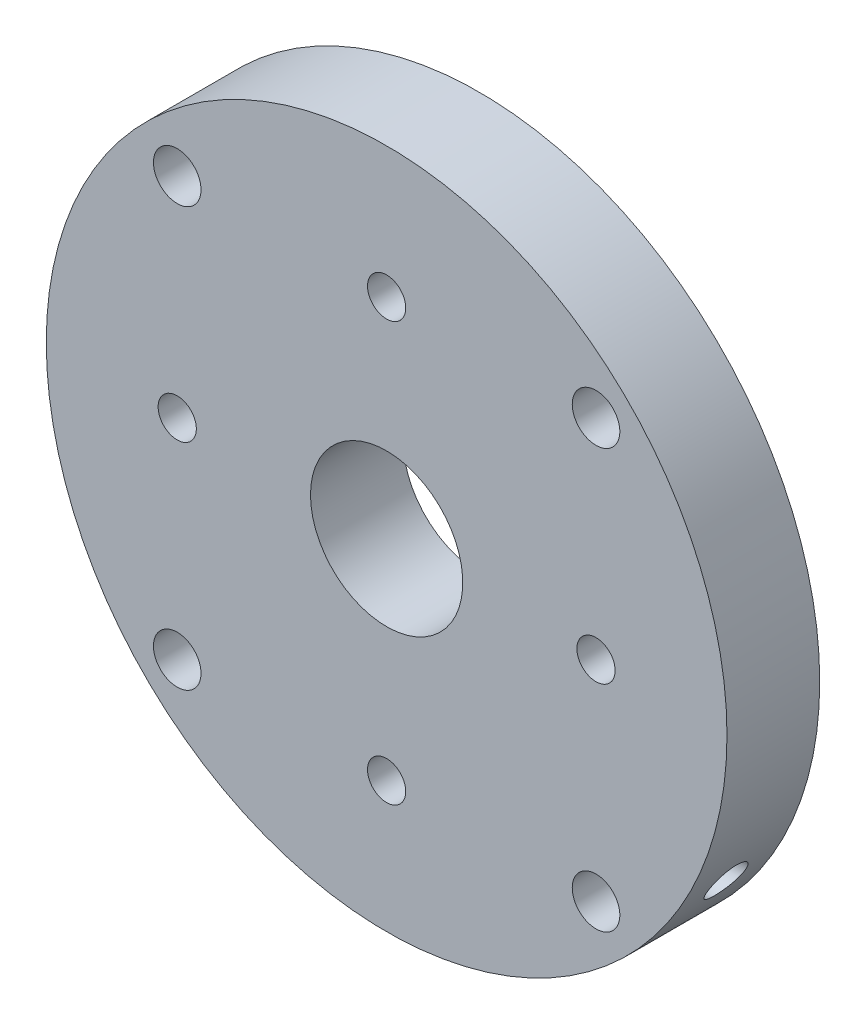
ISO-10303-21;
HEADER;
FILE_DESCRIPTION(('STEP AP214'),'2;1');
FILE_NAME('part.step','',(''),(''),'','','');
FILE_SCHEMA(('AUTOMOTIVE_DESIGN { 1 0 10303 214 1 1 1 1 }'));
ENDSEC;
DATA;
#1=APPLICATION_CONTEXT('core data for automotive mechanical design processes');
#2=APPLICATION_PROTOCOL_DEFINITION('international standard','automotive_design',2000,#1);
#3=PRODUCT_CONTEXT('',#1,'mechanical');
#4=PRODUCT('Part','Part','',(#3));
#5=PRODUCT_RELATED_PRODUCT_CATEGORY('part','',(#4));
#6=PRODUCT_DEFINITION_FORMATION('','',#4);
#7=PRODUCT_DEFINITION_CONTEXT('part definition',#1,'design');
#8=PRODUCT_DEFINITION('design','',#6,#7);
#9=PRODUCT_DEFINITION_SHAPE('','',#8);
#10=(LENGTH_UNIT() NAMED_UNIT(*) SI_UNIT(.MILLI.,.METRE.));
#11=(NAMED_UNIT(*) PLANE_ANGLE_UNIT() SI_UNIT($,.RADIAN.));
#12=(NAMED_UNIT(*) SI_UNIT($,.STERADIAN.) SOLID_ANGLE_UNIT());
#13=UNCERTAINTY_MEASURE_WITH_UNIT(LENGTH_MEASURE(1.E-05),#10,'distance_accuracy_value','');
#14=(GEOMETRIC_REPRESENTATION_CONTEXT(3) GLOBAL_UNCERTAINTY_ASSIGNED_CONTEXT((#13)) GLOBAL_UNIT_ASSIGNED_CONTEXT((#10,
#11,#12)) REPRESENTATION_CONTEXT('',''));
#15=CARTESIAN_POINT('',(0.,0.,0.));
#16=DIRECTION('',(0.,0.,1.));
#17=DIRECTION('',(1.,0.,0.));
#18=AXIS2_PLACEMENT_3D('',#15,#16,#17);
#19=CARTESIAN_POINT('',(5.16081818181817,0.,-7.7343));
#20=DIRECTION('',(0.,0.,1.));
#21=DIRECTION('',(1.,0.,0.));
#22=AXIS2_PLACEMENT_3D('',#19,#20,#21);
#23=PLANE('',#22);
#24=CARTESIAN_POINT('',(0.,0.,-7.7343));
#25=DIRECTION('',(0.,0.,1.));
#26=DIRECTION('',(1.,0.,0.));
#27=AXIS2_PLACEMENT_3D('',#24,#25,#26);
#28=CIRCLE('',#27,56.769);
#29=CARTESIAN_POINT('',(56.769,0.,-7.7343));
#30=VERTEX_POINT('',#29);
#31=EDGE_CURVE('E203',#30,#30,#28,.T.);
#32=ORIENTED_EDGE('',*,*,#31,.F.);
#33=EDGE_LOOP('',(#32));
#34=FACE_BOUND('',#33,.T.);
#35=CARTESIAN_POINT('',(0.,0.,-7.7343));
#36=DIRECTION('',(0.,0.,-1.));
#37=DIRECTION('',(-1.,0.,0.));
#38=AXIS2_PLACEMENT_3D('',#35,#36,#37);
#39=CIRCLE('',#38,12.7);
#40=CARTESIAN_POINT('',(-12.7,0.,-7.7343));
#41=VERTEX_POINT('',#40);
#42=EDGE_CURVE('E728',#41,#41,#39,.T.);
#43=ORIENTED_EDGE('',*,*,#42,.F.);
#44=EDGE_LOOP('',(#43));
#45=FACE_BOUND('',#44,.T.);
#46=CARTESIAN_POINT('',(-34.925,-34.925,-7.7343));
#47=DIRECTION('',(0.,0.,-1.));
#48=DIRECTION('',(-1.,0.,0.));
#49=AXIS2_PLACEMENT_3D('',#46,#47,#48);
#50=CIRCLE('',#49,3.96875);
#51=CARTESIAN_POINT('',(-38.89375,-34.925,-7.7343));
#52=VERTEX_POINT('',#51);
#53=EDGE_CURVE('E731',#52,#52,#50,.T.);
#54=ORIENTED_EDGE('',*,*,#53,.F.);
#55=EDGE_LOOP('',(#54));
#56=FACE_BOUND('',#55,.T.);
#57=CARTESIAN_POINT('',(34.925,34.925,-7.7343));
#58=DIRECTION('',(0.,0.,-1.));
#59=DIRECTION('',(-1.,0.,0.));
#60=AXIS2_PLACEMENT_3D('',#57,#58,#59);
#61=CIRCLE('',#60,3.96875);
#62=CARTESIAN_POINT('',(30.95625,34.925,-7.7343));
#63=VERTEX_POINT('',#62);
#64=EDGE_CURVE('E734',#63,#63,#61,.T.);
#65=ORIENTED_EDGE('',*,*,#64,.F.);
#66=EDGE_LOOP('',(#65));
#67=FACE_BOUND('',#66,.T.);
#68=CARTESIAN_POINT('',(-34.925,34.925,-7.7343));
#69=DIRECTION('',(0.,0.,-1.));
#70=DIRECTION('',(-1.,0.,0.));
#71=AXIS2_PLACEMENT_3D('',#68,#69,#70);
#72=CIRCLE('',#71,3.96875);
#73=CARTESIAN_POINT('',(-38.89375,34.925,-7.7343));
#74=VERTEX_POINT('',#73);
#75=EDGE_CURVE('E737',#74,#74,#72,.T.);
#76=ORIENTED_EDGE('',*,*,#75,.F.);
#77=EDGE_LOOP('',(#76));
#78=FACE_BOUND('',#77,.T.);
#79=CARTESIAN_POINT('',(34.925,-34.925,-7.7343));
#80=DIRECTION('',(0.,0.,-1.));
#81=DIRECTION('',(-1.,0.,0.));
#82=AXIS2_PLACEMENT_3D('',#79,#80,#81);
#83=CIRCLE('',#82,3.96875);
#84=CARTESIAN_POINT('',(30.95625,-34.925,-7.7343));
#85=VERTEX_POINT('',#84);
#86=EDGE_CURVE('E739',#85,#85,#83,.T.);
#87=ORIENTED_EDGE('',*,*,#86,.F.);
#88=EDGE_LOOP('',(#87));
#89=FACE_BOUND('',#88,.T.);
#90=CARTESIAN_POINT('',(20.0040940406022,-20.1374293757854,-7.7343));
#91=DIRECTION('',(0.,0.,1.));
#92=DIRECTION('',(1.,0.,0.));
#93=AXIS2_PLACEMENT_3D('',#90,#91,#92);
#94=CIRCLE('',#93,1.27);
#95=CARTESIAN_POINT('',(21.2740940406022,-20.1374293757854,-7.7343));
#96=VERTEX_POINT('',#95);
#97=EDGE_CURVE('E11',#96,#96,#94,.F.);
#98=ORIENTED_EDGE('',*,*,#97,.F.);
#99=EDGE_LOOP('',(#98));
#100=FACE_BOUND('',#99,.T.);
#101=ADVANCED_FACE('F33',(#34,#45,#56,#67,#78,#89,#100),#23,.F.);
#102=CARTESIAN_POINT('',(33.4645,-29.0137272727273,0.));
#103=DIRECTION('',(1.,0.,0.));
#104=DIRECTION('',(0.,0.,-1.));
#105=AXIS2_PLACEMENT_3D('',#102,#103,#104);
#106=PLANE('',#105);
#107=CARTESIAN_POINT('',(33.4645,-28.829,0.));
#108=DIRECTION('',(-1.,0.,0.));
#109=DIRECTION('',(0.,0.,1.));
#110=AXIS2_PLACEMENT_3D('',#107,#108,#109);
#111=CIRCLE('',#110,2.032);
#112=CARTESIAN_POINT('',(33.4645,-28.829,2.03200000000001));
#113=VERTEX_POINT('',#112);
#114=EDGE_CURVE('E137',#113,#113,#111,.F.);
#115=ORIENTED_EDGE('',*,*,#114,.T.);
#116=EDGE_LOOP('',(#115));
#117=FACE_BOUND('',#116,.T.);
#118=ADVANCED_FACE('F322',(#117),#106,.T.);
#119=CARTESIAN_POINT('',(-33.4645,-26.797,2.07264000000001));
#120=DIRECTION('',(-1.,0.,0.));
#121=DIRECTION('',(0.,0.,-1.));
#122=AXIS2_PLACEMENT_3D('',#119,#120,#121);
#123=PLANE('',#122);
#124=CARTESIAN_POINT('',(-33.4645,-28.829,0.));
#125=DIRECTION('',(1.,0.,0.));
#126=DIRECTION('',(0.,1.,0.));
#127=AXIS2_PLACEMENT_3D('',#124,#125,#126);
#128=CIRCLE('',#127,2.032);
#129=CARTESIAN_POINT('',(-33.4645,-26.797,0.));
#130=VERTEX_POINT('',#129);
#131=EDGE_CURVE('E134',#130,#130,#128,.F.);
#132=ORIENTED_EDGE('',*,*,#131,.T.);
#133=EDGE_LOOP('',(#132));
#134=FACE_BOUND('',#133,.T.);
#135=ADVANCED_FACE('F253',(#134),#123,.T.);
#136=CARTESIAN_POINT('',(22.3381119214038,-43.4340000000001,0.));
#137=DIRECTION('',(0.,1.,0.));
#138=DIRECTION('',(0.,0.,1.));
#139=AXIS2_PLACEMENT_3D('',#136,#137,#138);
#140=PLANE('',#139);
#141=DIRECTION('',(0.5,0.,0.866025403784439));
#142=VECTOR('',#141,1.);
#143=CARTESIAN_POINT('',(21.2019014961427,-43.4340000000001,1.96797418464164));
#144=LINE('',#143,#142);
#145=CARTESIAN_POINT('',(21.2019014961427,-43.4340000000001,1.96797418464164));
#146=VERTEX_POINT('',#145);
#147=CARTESIAN_POINT('',(20.0656910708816,-43.4340000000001,0.));
#148=VERTEX_POINT('',#147);
#149=EDGE_CURVE('E136',#146,#148,#144,.F.);
#150=ORIENTED_EDGE('',*,*,#149,.T.);
#151=DIRECTION('',(-0.5,0.,0.866025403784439));
#152=VECTOR('',#151,1.);
#153=CARTESIAN_POINT('',(20.0656910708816,-43.4340000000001,0.));
#154=LINE('',#153,#152);
#155=CARTESIAN_POINT('',(21.2019014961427,-43.4340000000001,-1.96797418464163));
#156=VERTEX_POINT('',#155);
#157=EDGE_CURVE('E150',#148,#156,#154,.F.);
#158=ORIENTED_EDGE('',*,*,#157,.T.);
#159=DIRECTION('',(-1.,0.,0.));
#160=VECTOR('',#159,1.);
#161=CARTESIAN_POINT('',(21.2019014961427,-43.4340000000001,-1.96797418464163));
#162=LINE('',#161,#160);
#163=CARTESIAN_POINT('',(23.4743223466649,-43.4340000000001,-1.96797418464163));
#164=VERTEX_POINT('',#163);
#165=EDGE_CURVE('E156',#156,#164,#162,.F.);
#166=ORIENTED_EDGE('',*,*,#165,.T.);
#167=DIRECTION('',(-0.5,0.,-0.866025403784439));
#168=VECTOR('',#167,1.);
#169=CARTESIAN_POINT('',(23.4743223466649,-43.4340000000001,-1.96797418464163));
#170=LINE('',#169,#168);
#171=CARTESIAN_POINT('',(24.610532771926,-43.4340000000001,0.));
#172=VERTEX_POINT('',#171);
#173=EDGE_CURVE('E162',#164,#172,#170,.F.);
#174=ORIENTED_EDGE('',*,*,#173,.T.);
#175=DIRECTION('',(0.5,0.,-0.866025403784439));
#176=VECTOR('',#175,1.);
#177=CARTESIAN_POINT('',(24.610532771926,-43.4340000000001,0.));
#178=LINE('',#177,#176);
#179=CARTESIAN_POINT('',(23.4743223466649,-43.4340000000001,1.96797418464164));
#180=VERTEX_POINT('',#179);
#181=EDGE_CURVE('E168',#172,#180,#178,.F.);
#182=ORIENTED_EDGE('',*,*,#181,.T.);
#183=DIRECTION('',(1.,0.,0.));
#184=VECTOR('',#183,1.);
#185=CARTESIAN_POINT('',(23.4743223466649,-43.4340000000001,1.96797418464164));
#186=LINE('',#185,#184);
#187=EDGE_CURVE('E99',#180,#146,#186,.F.);
#188=ORIENTED_EDGE('',*,*,#187,.T.);
#189=EDGE_LOOP('',(#150,#158,#166,#174,#182,#188));
#190=FACE_BOUND('',#189,.T.);
#191=ADVANCED_FACE('F312',(#190),#140,.F.);
#192=CARTESIAN_POINT('',(-24.610532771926,-43.4340000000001,-1.96797418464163));
#193=DIRECTION('',(0.,1.,0.));
#194=DIRECTION('',(0.,0.,1.));
#195=AXIS2_PLACEMENT_3D('',#192,#193,#194);
#196=PLANE('',#195);
#197=DIRECTION('',(-0.500000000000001,0.,-0.866025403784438));
#198=VECTOR('',#197,1.);
#199=CARTESIAN_POINT('',(-23.4743223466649,-43.4340000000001,1.96797418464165));
#200=LINE('',#199,#198);
#201=CARTESIAN_POINT('',(-23.4743223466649,-43.4340000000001,1.96797418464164));
#202=VERTEX_POINT('',#201);
#203=CARTESIAN_POINT('',(-24.610532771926,-43.4340000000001,0.));
#204=VERTEX_POINT('',#203);
#205=EDGE_CURVE('E89',#202,#204,#200,.T.);
#206=ORIENTED_EDGE('',*,*,#205,.T.);
#207=DIRECTION('',(0.5,0.,-0.866025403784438));
#208=VECTOR('',#207,1.);
#209=CARTESIAN_POINT('',(-24.610532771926,-43.4340000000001,0.));
#210=LINE('',#209,#208);
#211=CARTESIAN_POINT('',(-23.4743223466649,-43.4340000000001,-1.96797418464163));
#212=VERTEX_POINT('',#211);
#213=EDGE_CURVE('E131',#204,#212,#210,.T.);
#214=ORIENTED_EDGE('',*,*,#213,.T.);
#215=DIRECTION('',(1.,0.,0.));
#216=VECTOR('',#215,1.);
#217=CARTESIAN_POINT('',(-24.610532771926,-43.4340000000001,-1.96797418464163));
#218=LINE('',#217,#216);
#219=CARTESIAN_POINT('',(-21.2019014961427,-43.4340000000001,-1.96797418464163));
#220=VERTEX_POINT('',#219);
#221=EDGE_CURVE('E126',#212,#220,#218,.T.);
#222=ORIENTED_EDGE('',*,*,#221,.T.);
#223=DIRECTION('',(0.500000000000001,0.,0.866025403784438));
#224=VECTOR('',#223,1.);
#225=CARTESIAN_POINT('',(-21.2019014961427,-43.4340000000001,-1.96797418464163));
#226=LINE('',#225,#224);
#227=CARTESIAN_POINT('',(-20.0656910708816,-43.4340000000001,0.));
#228=VERTEX_POINT('',#227);
#229=EDGE_CURVE('E121',#220,#228,#226,.T.);
#230=ORIENTED_EDGE('',*,*,#229,.T.);
#231=DIRECTION('',(-0.500000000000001,0.,0.866025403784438));
#232=VECTOR('',#231,1.);
#233=CARTESIAN_POINT('',(-20.0656910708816,-43.4340000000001,0.));
#234=LINE('',#233,#232);
#235=CARTESIAN_POINT('',(-21.2019014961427,-43.4340000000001,1.96797418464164));
#236=VERTEX_POINT('',#235);
#237=EDGE_CURVE('E105',#228,#236,#234,.T.);
#238=ORIENTED_EDGE('',*,*,#237,.T.);
#239=DIRECTION('',(1.,0.,0.));
#240=VECTOR('',#239,1.);
#241=CARTESIAN_POINT('',(-24.610532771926,-43.4340000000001,1.96797418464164));
#242=LINE('',#241,#240);
#243=EDGE_CURVE('E102',#236,#202,#242,.F.);
#244=ORIENTED_EDGE('',*,*,#243,.T.);
#245=EDGE_LOOP('',(#206,#214,#222,#230,#238,#244));
#246=FACE_BOUND('',#245,.T.);
#247=ADVANCED_FACE('F103',(#246),#196,.F.);
#248=CARTESIAN_POINT('',(43.6245,-28.829,0.));
#249=DIRECTION('',(-1.,0.,0.));
#250=DIRECTION('',(0.,0.,1.));
#251=AXIS2_PLACEMENT_3D('',#248,#249,#250);
#252=CYLINDRICAL_SURFACE('',#251,2.032);
#253=ORIENTED_EDGE('',*,*,#114,.F.);
#254=EDGE_LOOP('',(#253));
#255=FACE_BOUND('',#254,.T.);
#256=CARTESIAN_POINT('',(43.6245,-28.829,0.));
#257=DIRECTION('',(-1.,0.,0.));
#258=DIRECTION('',(0.,0.,1.));
#259=AXIS2_PLACEMENT_3D('',#256,#257,#258);
#260=CIRCLE('',#259,2.032);
#261=CARTESIAN_POINT('',(43.6245,-28.829,2.03200000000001));
#262=VERTEX_POINT('',#261);
#263=EDGE_CURVE('E107',#262,#262,#260,.T.);
#264=ORIENTED_EDGE('',*,*,#263,.F.);
#265=EDGE_LOOP('',(#264));
#266=FACE_BOUND('',#265,.T.);
#267=ADVANCED_FACE('F309',(#255,#266),#252,.F.);
#268=CARTESIAN_POINT('',(-43.6245,-28.829,0.));
#269=DIRECTION('',(1.,0.,0.));
#270=DIRECTION('',(0.,1.,0.));
#271=AXIS2_PLACEMENT_3D('',#268,#269,#270);
#272=CYLINDRICAL_SURFACE('',#271,2.032);
#273=ORIENTED_EDGE('',*,*,#131,.F.);
#274=EDGE_LOOP('',(#273));
#275=FACE_BOUND('',#274,.T.);
#276=CARTESIAN_POINT('',(-43.6245,-28.829,0.));
#277=DIRECTION('',(1.,0.,0.));
#278=DIRECTION('',(0.,1.,0.));
#279=AXIS2_PLACEMENT_3D('',#276,#277,#278);
#280=CIRCLE('',#279,2.032);
#281=CARTESIAN_POINT('',(-43.6245,-26.797,0.));
#282=VERTEX_POINT('',#281);
#283=EDGE_CURVE('E200',#282,#282,#280,.T.);
#284=ORIENTED_EDGE('',*,*,#283,.F.);
#285=EDGE_LOOP('',(#284));
#286=FACE_BOUND('',#285,.T.);
#287=ADVANCED_FACE('F306',(#275,#286),#272,.F.);
#288=CARTESIAN_POINT('',(21.2019014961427,-45.974,1.96797418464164));
#289=DIRECTION('',(-0.866025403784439,0.,0.5));
#290=DIRECTION('',(0.5,0.,0.866025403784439));
#291=AXIS2_PLACEMENT_3D('',#288,#289,#290);
#292=PLANE('',#291);
#293=DIRECTION('',(0.,1.,0.));
#294=VECTOR('',#293,1.);
#295=CARTESIAN_POINT('',(21.2019014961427,-45.974,1.96797418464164));
#296=LINE('',#295,#294);
#297=CARTESIAN_POINT('',(21.2019014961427,-45.974,1.96797418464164));
#298=VERTEX_POINT('',#297);
#299=EDGE_CURVE('E171',#146,#298,#296,.F.);
#300=ORIENTED_EDGE('',*,*,#299,.T.);
#301=DIRECTION('',(-0.500000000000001,0.,-0.866025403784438));
#302=VECTOR('',#301,1.);
#303=CARTESIAN_POINT('',(21.2019014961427,-45.974,1.96797418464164));
#304=LINE('',#303,#302);
#305=CARTESIAN_POINT('',(20.0656910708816,-45.974,0.));
#306=VERTEX_POINT('',#305);
#307=EDGE_CURVE('E197',#298,#306,#304,.T.);
#308=ORIENTED_EDGE('',*,*,#307,.T.);
#309=DIRECTION('',(0.,1.,0.));
#310=VECTOR('',#309,1.);
#311=CARTESIAN_POINT('',(20.0656910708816,-45.974,0.));
#312=LINE('',#311,#310);
#313=EDGE_CURVE('E149',#306,#148,#312,.T.);
#314=ORIENTED_EDGE('',*,*,#313,.T.);
#315=ORIENTED_EDGE('',*,*,#149,.F.);
#316=EDGE_LOOP('',(#300,#308,#314,#315));
#317=FACE_BOUND('',#316,.T.);
#318=ADVANCED_FACE('F308',(#317),#292,.F.);
#319=CARTESIAN_POINT('',(20.0656910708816,-45.974,0.));
#320=DIRECTION('',(-0.866025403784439,0.,-0.5));
#321=DIRECTION('',(-0.5,0.,0.866025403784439));
#322=AXIS2_PLACEMENT_3D('',#319,#320,#321);
#323=PLANE('',#322);
#324=ORIENTED_EDGE('',*,*,#313,.F.);
#325=DIRECTION('',(0.5,0.,-0.866025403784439));
#326=VECTOR('',#325,1.);
#327=CARTESIAN_POINT('',(20.0656910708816,-45.974,0.));
#328=LINE('',#327,#326);
#329=CARTESIAN_POINT('',(21.2019014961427,-45.974,-1.96797418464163));
#330=VERTEX_POINT('',#329);
#331=EDGE_CURVE('E194',#306,#330,#328,.T.);
#332=ORIENTED_EDGE('',*,*,#331,.T.);
#333=DIRECTION('',(0.,1.,0.));
#334=VECTOR('',#333,1.);
#335=CARTESIAN_POINT('',(21.2019014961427,-45.974,-1.96797418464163));
#336=LINE('',#335,#334);
#337=EDGE_CURVE('E153',#330,#156,#336,.T.);
#338=ORIENTED_EDGE('',*,*,#337,.T.);
#339=ORIENTED_EDGE('',*,*,#157,.F.);
#340=EDGE_LOOP('',(#324,#332,#338,#339));
#341=FACE_BOUND('',#340,.T.);
#342=ADVANCED_FACE('F408',(#341),#323,.F.);
#343=CARTESIAN_POINT('',(21.2019014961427,-45.974,-1.96797418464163));
#344=DIRECTION('',(0.,0.,-1.));
#345=DIRECTION('',(-1.,0.,0.));
#346=AXIS2_PLACEMENT_3D('',#343,#344,#345);
#347=PLANE('',#346);
#348=ORIENTED_EDGE('',*,*,#337,.F.);
#349=DIRECTION('',(1.,0.,0.));
#350=VECTOR('',#349,1.);
#351=CARTESIAN_POINT('',(22.609430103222,-45.974,-1.96797418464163));
#352=LINE('',#351,#350);
#353=CARTESIAN_POINT('',(23.4743223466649,-45.974,-1.96797418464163));
#354=VERTEX_POINT('',#353);
#355=EDGE_CURVE('E191',#330,#354,#352,.T.);
#356=ORIENTED_EDGE('',*,*,#355,.T.);
#357=DIRECTION('',(0.,1.,0.));
#358=VECTOR('',#357,1.);
#359=CARTESIAN_POINT('',(23.4743223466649,-45.974,-1.96797418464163));
#360=LINE('',#359,#358);
#361=EDGE_CURVE('E159',#354,#164,#360,.T.);
#362=ORIENTED_EDGE('',*,*,#361,.T.);
#363=ORIENTED_EDGE('',*,*,#165,.F.);
#364=EDGE_LOOP('',(#348,#356,#362,#363));
#365=FACE_BOUND('',#364,.T.);
#366=ADVANCED_FACE('F404',(#365),#347,.F.);
#367=CARTESIAN_POINT('',(23.4743223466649,-45.974,-1.96797418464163));
#368=DIRECTION('',(0.866025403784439,0.,-0.5));
#369=DIRECTION('',(-0.5,0.,-0.866025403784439));
#370=AXIS2_PLACEMENT_3D('',#367,#368,#369);
#371=PLANE('',#370);
#372=ORIENTED_EDGE('',*,*,#361,.F.);
#373=DIRECTION('',(0.5,0.,0.866025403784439));
#374=VECTOR('',#373,1.);
#375=CARTESIAN_POINT('',(23.4743223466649,-45.974,-1.96797418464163));
#376=LINE('',#375,#374);
#377=CARTESIAN_POINT('',(24.610532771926,-45.974,0.));
#378=VERTEX_POINT('',#377);
#379=EDGE_CURVE('E188',#354,#378,#376,.T.);
#380=ORIENTED_EDGE('',*,*,#379,.T.);
#381=DIRECTION('',(0.,1.,0.));
#382=VECTOR('',#381,1.);
#383=CARTESIAN_POINT('',(24.610532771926,-45.974,0.));
#384=LINE('',#383,#382);
#385=EDGE_CURVE('E165',#378,#172,#384,.T.);
#386=ORIENTED_EDGE('',*,*,#385,.T.);
#387=ORIENTED_EDGE('',*,*,#173,.F.);
#388=EDGE_LOOP('',(#372,#380,#386,#387));
#389=FACE_BOUND('',#388,.T.);
#390=ADVANCED_FACE('F400',(#389),#371,.F.);
#391=CARTESIAN_POINT('',(24.610532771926,-45.974,0.));
#392=DIRECTION('',(0.866025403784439,0.,0.5));
#393=DIRECTION('',(0.5,0.,-0.866025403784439));
#394=AXIS2_PLACEMENT_3D('',#391,#392,#393);
#395=PLANE('',#394);
#396=ORIENTED_EDGE('',*,*,#385,.F.);
#397=DIRECTION('',(-0.500000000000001,0.,0.866025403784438));
#398=VECTOR('',#397,1.);
#399=CARTESIAN_POINT('',(24.610532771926,-45.974,0.));
#400=LINE('',#399,#398);
#401=CARTESIAN_POINT('',(23.4743223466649,-45.974,1.96797418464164));
#402=VERTEX_POINT('',#401);
#403=EDGE_CURVE('E185',#378,#402,#400,.T.);
#404=ORIENTED_EDGE('',*,*,#403,.T.);
#405=DIRECTION('',(0.,1.,0.));
#406=VECTOR('',#405,1.);
#407=CARTESIAN_POINT('',(23.4743223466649,-45.974,1.96797418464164));
#408=LINE('',#407,#406);
#409=EDGE_CURVE('E176',#402,#180,#408,.T.);
#410=ORIENTED_EDGE('',*,*,#409,.T.);
#411=ORIENTED_EDGE('',*,*,#181,.F.);
#412=EDGE_LOOP('',(#396,#404,#410,#411));
#413=FACE_BOUND('',#412,.T.);
#414=ADVANCED_FACE('F396',(#413),#395,.F.);
#415=CARTESIAN_POINT('',(23.4743223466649,-45.974,1.96797418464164));
#416=DIRECTION('',(0.,0.,1.));
#417=DIRECTION('',(1.,0.,0.));
#418=AXIS2_PLACEMENT_3D('',#415,#416,#417);
#419=PLANE('',#418);
#420=ORIENTED_EDGE('',*,*,#409,.F.);
#421=DIRECTION('',(1.,0.,0.));
#422=VECTOR('',#421,1.);
#423=CARTESIAN_POINT('',(22.609430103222,-45.974,1.96797418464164));
#424=LINE('',#423,#422);
#425=EDGE_CURVE('E181',#402,#298,#424,.F.);
#426=ORIENTED_EDGE('',*,*,#425,.T.);
#427=ORIENTED_EDGE('',*,*,#299,.F.);
#428=ORIENTED_EDGE('',*,*,#187,.F.);
#429=EDGE_LOOP('',(#420,#426,#427,#428));
#430=FACE_BOUND('',#429,.T.);
#431=ADVANCED_FACE('F305',(#430),#419,.F.);
#432=CARTESIAN_POINT('',(-23.4743223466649,-43.434,1.96797418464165));
#433=DIRECTION('',(-0.866025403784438,0.,0.500000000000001));
#434=DIRECTION('',(-0.500000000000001,0.,-0.866025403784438));
#435=AXIS2_PLACEMENT_3D('',#432,#433,#434);
#436=PLANE('',#435);
#437=DIRECTION('',(0.,-1.,0.));
#438=VECTOR('',#437,1.);
#439=CARTESIAN_POINT('',(-23.4743223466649,-43.434,1.96797418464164));
#440=LINE('',#439,#438);
#441=CARTESIAN_POINT('',(-23.4743223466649,-45.974,1.96797418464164));
#442=VERTEX_POINT('',#441);
#443=EDGE_CURVE('E93',#202,#442,#440,.T.);
#444=ORIENTED_EDGE('',*,*,#443,.T.);
#445=DIRECTION('',(-0.500000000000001,0.,-0.866025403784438));
#446=VECTOR('',#445,1.);
#447=CARTESIAN_POINT('',(-23.4743223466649,-45.974,1.96797418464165));
#448=LINE('',#447,#446);
#449=CARTESIAN_POINT('',(-24.610532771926,-45.974,0.));
#450=VERTEX_POINT('',#449);
#451=EDGE_CURVE('E184',#442,#450,#448,.T.);
#452=ORIENTED_EDGE('',*,*,#451,.T.);
#453=DIRECTION('',(0.,-1.,0.));
#454=VECTOR('',#453,1.);
#455=CARTESIAN_POINT('',(-24.610532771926,-43.434,0.));
#456=LINE('',#455,#454);
#457=EDGE_CURVE('E96',#450,#204,#456,.F.);
#458=ORIENTED_EDGE('',*,*,#457,.T.);
#459=ORIENTED_EDGE('',*,*,#205,.F.);
#460=EDGE_LOOP('',(#444,#452,#458,#459));
#461=FACE_BOUND('',#460,.T.);
#462=ADVANCED_FACE('F91',(#461),#436,.F.);
#463=CARTESIAN_POINT('',(-24.610532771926,-43.434,0.));
#464=DIRECTION('',(-0.866025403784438,0.,-0.5));
#465=DIRECTION('',(0.5,0.,-0.866025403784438));
#466=AXIS2_PLACEMENT_3D('',#463,#464,#465);
#467=PLANE('',#466);
#468=ORIENTED_EDGE('',*,*,#457,.F.);
#469=DIRECTION('',(0.5,0.,-0.866025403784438));
#470=VECTOR('',#469,1.);
#471=CARTESIAN_POINT('',(-24.610532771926,-45.974,0.));
#472=LINE('',#471,#470);
#473=CARTESIAN_POINT('',(-23.4743223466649,-45.974,-1.96797418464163));
#474=VERTEX_POINT('',#473);
#475=EDGE_CURVE('E696',#450,#474,#472,.T.);
#476=ORIENTED_EDGE('',*,*,#475,.T.);
#477=DIRECTION('',(0.,-1.,0.));
#478=VECTOR('',#477,1.);
#479=CARTESIAN_POINT('',(-23.4743223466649,-43.434,-1.96797418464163));
#480=LINE('',#479,#478);
#481=EDGE_CURVE('E128',#474,#212,#480,.F.);
#482=ORIENTED_EDGE('',*,*,#481,.T.);
#483=ORIENTED_EDGE('',*,*,#213,.F.);
#484=EDGE_LOOP('',(#468,#476,#482,#483));
#485=FACE_BOUND('',#484,.T.);
#486=ADVANCED_FACE('F298',(#485),#467,.F.);
#487=CARTESIAN_POINT('',(-23.4743223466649,-43.434,-1.96797418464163));
#488=DIRECTION('',(0.,0.,-1.));
#489=DIRECTION('',(1.,0.,0.));
#490=AXIS2_PLACEMENT_3D('',#487,#488,#489);
#491=PLANE('',#490);
#492=ORIENTED_EDGE('',*,*,#481,.F.);
#493=DIRECTION('',(1.,0.,0.));
#494=VECTOR('',#493,1.);
#495=CARTESIAN_POINT('',(-23.4743223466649,-45.974,-1.96797418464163));
#496=LINE('',#495,#494);
#497=CARTESIAN_POINT('',(-21.2019014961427,-45.974,-1.96797418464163));
#498=VERTEX_POINT('',#497);
#499=EDGE_CURVE('E698',#474,#498,#496,.T.);
#500=ORIENTED_EDGE('',*,*,#499,.T.);
#501=DIRECTION('',(0.,-1.,0.));
#502=VECTOR('',#501,1.);
#503=CARTESIAN_POINT('',(-21.2019014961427,-43.434,-1.96797418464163));
#504=LINE('',#503,#502);
#505=EDGE_CURVE('E123',#498,#220,#504,.F.);
#506=ORIENTED_EDGE('',*,*,#505,.T.);
#507=ORIENTED_EDGE('',*,*,#221,.F.);
#508=EDGE_LOOP('',(#492,#500,#506,#507));
#509=FACE_BOUND('',#508,.T.);
#510=ADVANCED_FACE('F294',(#509),#491,.F.);
#511=CARTESIAN_POINT('',(-21.2019014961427,-43.434,-1.96797418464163));
#512=DIRECTION('',(0.866025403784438,0.,-0.500000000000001));
#513=DIRECTION('',(0.500000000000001,0.,0.866025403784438));
#514=AXIS2_PLACEMENT_3D('',#511,#512,#513);
#515=PLANE('',#514);
#516=ORIENTED_EDGE('',*,*,#505,.F.);
#517=DIRECTION('',(0.500000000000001,0.,0.866025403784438));
#518=VECTOR('',#517,1.);
#519=CARTESIAN_POINT('',(-21.2019014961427,-45.974,-1.96797418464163));
#520=LINE('',#519,#518);
#521=CARTESIAN_POINT('',(-20.0656910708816,-45.974,0.));
#522=VERTEX_POINT('',#521);
#523=EDGE_CURVE('E700',#498,#522,#520,.T.);
#524=ORIENTED_EDGE('',*,*,#523,.T.);
#525=DIRECTION('',(0.,-1.,0.));
#526=VECTOR('',#525,1.);
#527=CARTESIAN_POINT('',(-20.0656910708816,-43.434,0.));
#528=LINE('',#527,#526);
#529=EDGE_CURVE('E116',#522,#228,#528,.F.);
#530=ORIENTED_EDGE('',*,*,#529,.T.);
#531=ORIENTED_EDGE('',*,*,#229,.F.);
#532=EDGE_LOOP('',(#516,#524,#530,#531));
#533=FACE_BOUND('',#532,.T.);
#534=ADVANCED_FACE('F291',(#533),#515,.F.);
#535=CARTESIAN_POINT('',(-20.0656910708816,-43.434,0.));
#536=DIRECTION('',(0.866025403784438,0.,0.500000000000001));
#537=DIRECTION('',(-0.500000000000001,0.,0.866025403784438));
#538=AXIS2_PLACEMENT_3D('',#535,#536,#537);
#539=PLANE('',#538);
#540=ORIENTED_EDGE('',*,*,#529,.F.);
#541=DIRECTION('',(-0.500000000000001,0.,0.866025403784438));
#542=VECTOR('',#541,1.);
#543=CARTESIAN_POINT('',(-20.0656910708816,-45.974,0.));
#544=LINE('',#543,#542);
#545=CARTESIAN_POINT('',(-21.2019014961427,-45.974,1.96797418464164));
#546=VERTEX_POINT('',#545);
#547=EDGE_CURVE('E51',#522,#546,#544,.T.);
#548=ORIENTED_EDGE('',*,*,#547,.T.);
#549=DIRECTION('',(0.,-1.,0.));
#550=VECTOR('',#549,1.);
#551=CARTESIAN_POINT('',(-21.2019014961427,-43.434,1.96797418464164));
#552=LINE('',#551,#550);
#553=EDGE_CURVE('E108',#546,#236,#552,.F.);
#554=ORIENTED_EDGE('',*,*,#553,.T.);
#555=ORIENTED_EDGE('',*,*,#237,.F.);
#556=EDGE_LOOP('',(#540,#548,#554,#555));
#557=FACE_BOUND('',#556,.T.);
#558=ADVANCED_FACE('F288',(#557),#539,.F.);
#559=CARTESIAN_POINT('',(-21.2019014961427,-43.434,1.96797418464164));
#560=DIRECTION('',(0.,0.,1.));
#561=DIRECTION('',(-1.,0.,0.));
#562=AXIS2_PLACEMENT_3D('',#559,#560,#561);
#563=PLANE('',#562);
#564=ORIENTED_EDGE('',*,*,#553,.F.);
#565=DIRECTION('',(-1.,0.,0.));
#566=VECTOR('',#565,1.);
#567=CARTESIAN_POINT('',(-21.2019014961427,-45.974,1.96797418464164));
#568=LINE('',#567,#566);
#569=EDGE_CURVE('E112',#546,#442,#568,.T.);
#570=ORIENTED_EDGE('',*,*,#569,.T.);
#571=ORIENTED_EDGE('',*,*,#443,.F.);
#572=ORIENTED_EDGE('',*,*,#243,.F.);
#573=EDGE_LOOP('',(#564,#570,#571,#572));
#574=FACE_BOUND('',#573,.T.);
#575=ADVANCED_FACE('F110',(#574),#563,.F.);
#576=CARTESIAN_POINT('',(43.6245,-29.1176363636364,0.));
#577=DIRECTION('',(1.,0.,0.));
#578=DIRECTION('',(0.,0.,-1.));
#579=AXIS2_PLACEMENT_3D('',#576,#577,#578);
#580=PLANE('',#579);
#581=ORIENTED_EDGE('',*,*,#263,.T.);
#582=EDGE_LOOP('',(#581));
#583=FACE_BOUND('',#582,.T.);
#584=CARTESIAN_POINT('',(43.6245,-28.829,0.));
#585=DIRECTION('',(1.,0.,0.));
#586=DIRECTION('',(0.,0.,-1.));
#587=AXIS2_PLACEMENT_3D('',#584,#585,#586);
#588=CIRCLE('',#587,3.175);
#589=CARTESIAN_POINT('',(43.6245,-28.829,-3.17499999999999));
#590=VERTEX_POINT('',#589);
#591=EDGE_CURVE('E704',#590,#590,#588,.T.);
#592=ORIENTED_EDGE('',*,*,#591,.T.);
#593=EDGE_LOOP('',(#592));
#594=FACE_BOUND('',#593,.T.);
#595=ADVANCED_FACE('F284',(#583,#594),#580,.T.);
#596=CARTESIAN_POINT('',(-43.6245,-25.654,3.23850000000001));
#597=DIRECTION('',(-1.,0.,0.));
#598=DIRECTION('',(0.,0.,-1.));
#599=AXIS2_PLACEMENT_3D('',#596,#597,#598);
#600=PLANE('',#599);
#601=ORIENTED_EDGE('',*,*,#283,.T.);
#602=EDGE_LOOP('',(#601));
#603=FACE_BOUND('',#602,.T.);
#604=CARTESIAN_POINT('',(-43.6245,-28.829,0.));
#605=DIRECTION('',(-1.,0.,0.));
#606=DIRECTION('',(0.,0.,1.));
#607=AXIS2_PLACEMENT_3D('',#604,#605,#606);
#608=CIRCLE('',#607,3.175);
#609=CARTESIAN_POINT('',(-43.6245,-28.829,3.17500000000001));
#610=VERTEX_POINT('',#609);
#611=EDGE_CURVE('E707',#610,#610,#608,.T.);
#612=ORIENTED_EDGE('',*,*,#611,.T.);
#613=EDGE_LOOP('',(#612));
#614=FACE_BOUND('',#613,.T.);
#615=ADVANCED_FACE('F281',(#603,#614),#600,.T.);
#616=CARTESIAN_POINT('',(22.609430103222,-45.974,0.));
#617=DIRECTION('',(0.,1.,0.));
#618=DIRECTION('',(0.,0.,1.));
#619=AXIS2_PLACEMENT_3D('',#616,#617,#618);
#620=PLANE('',#619);
#621=ORIENTED_EDGE('',*,*,#403,.F.);
#622=ORIENTED_EDGE('',*,*,#379,.F.);
#623=ORIENTED_EDGE('',*,*,#355,.F.);
#624=ORIENTED_EDGE('',*,*,#331,.F.);
#625=ORIENTED_EDGE('',*,*,#307,.F.);
#626=ORIENTED_EDGE('',*,*,#425,.F.);
#627=EDGE_LOOP('',(#621,#622,#623,#624,#625,#626));
#628=FACE_BOUND('',#627,.T.);
#629=CARTESIAN_POINT('',(22.3381119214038,-45.974,0.));
#630=DIRECTION('',(0.,-1.,0.));
#631=DIRECTION('',(0.,0.,-1.));
#632=AXIS2_PLACEMENT_3D('',#629,#630,#631);
#633=CIRCLE('',#632,2.9845);
#634=CARTESIAN_POINT('',(22.3381119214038,-45.974,-2.98449999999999));
#635=VERTEX_POINT('',#634);
#636=EDGE_CURVE('E710',#635,#635,#633,.T.);
#637=ORIENTED_EDGE('',*,*,#636,.T.);
#638=EDGE_LOOP('',(#637));
#639=FACE_BOUND('',#638,.T.);
#640=ADVANCED_FACE('F279',(#628,#639),#620,.F.);
#641=CARTESIAN_POINT('',(-25.3226119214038,-45.974,-3.04418999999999));
#642=DIRECTION('',(0.,1.,0.));
#643=DIRECTION('',(0.,0.,1.));
#644=AXIS2_PLACEMENT_3D('',#641,#642,#643);
#645=PLANE('',#644);
#646=ORIENTED_EDGE('',*,*,#547,.F.);
#647=ORIENTED_EDGE('',*,*,#523,.F.);
#648=ORIENTED_EDGE('',*,*,#499,.F.);
#649=ORIENTED_EDGE('',*,*,#475,.F.);
#650=ORIENTED_EDGE('',*,*,#451,.F.);
#651=ORIENTED_EDGE('',*,*,#569,.F.);
#652=EDGE_LOOP('',(#646,#647,#648,#649,#650,#651));
#653=FACE_BOUND('',#652,.T.);
#654=CARTESIAN_POINT('',(-22.3381119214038,-45.974,0.));
#655=DIRECTION('',(0.,-1.,0.));
#656=DIRECTION('',(0.,0.,-1.));
#657=AXIS2_PLACEMENT_3D('',#654,#655,#656);
#658=CIRCLE('',#657,2.9845);
#659=CARTESIAN_POINT('',(-22.3381119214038,-45.974,-2.98449999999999));
#660=VERTEX_POINT('',#659);
#661=EDGE_CURVE('E713',#660,#660,#658,.T.);
#662=ORIENTED_EDGE('',*,*,#661,.T.);
#663=EDGE_LOOP('',(#662));
#664=FACE_BOUND('',#663,.T.);
#665=ADVANCED_FACE('F275',(#653,#664),#645,.F.);
#666=CARTESIAN_POINT('',(-35.2147909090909,0.,1.3843));
#667=DIRECTION('',(0.,0.,1.));
#668=DIRECTION('',(1.,0.,0.));
#669=AXIS2_PLACEMENT_3D('',#666,#667,#668);
#670=PLANE('',#669);
#671=CARTESIAN_POINT('',(-34.925,0.,1.3843));
#672=DIRECTION('',(0.,0.,1.));
#673=DIRECTION('',(1.,0.,0.));
#674=AXIS2_PLACEMENT_3D('',#671,#672,#673);
#675=CIRCLE('',#674,3.1877);
#676=CARTESIAN_POINT('',(-31.7373,0.,1.3843));
#677=VERTEX_POINT('',#676);
#678=EDGE_CURVE('E716',#677,#677,#675,.T.);
#679=ORIENTED_EDGE('',*,*,#678,.T.);
#680=EDGE_LOOP('',(#679));
#681=FACE_BOUND('',#680,.T.);
#682=ADVANCED_FACE('F278',(#681),#670,.T.);
#683=CARTESIAN_POINT('',(0.,35.2147909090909,1.3843));
#684=DIRECTION('',(0.,0.,1.));
#685=DIRECTION('',(1.,0.,0.));
#686=AXIS2_PLACEMENT_3D('',#683,#684,#685);
#687=PLANE('',#686);
#688=CARTESIAN_POINT('',(0.,34.925,1.3843));
#689=DIRECTION('',(0.,0.,1.));
#690=DIRECTION('',(1.,0.,0.));
#691=AXIS2_PLACEMENT_3D('',#688,#689,#690);
#692=CIRCLE('',#691,3.1877);
#693=CARTESIAN_POINT('',(3.1877,34.925,1.3843));
#694=VERTEX_POINT('',#693);
#695=EDGE_CURVE('E719',#694,#694,#692,.T.);
#696=ORIENTED_EDGE('',*,*,#695,.T.);
#697=EDGE_LOOP('',(#696));
#698=FACE_BOUND('',#697,.T.);
#699=ADVANCED_FACE('F380',(#698),#687,.T.);
#700=CARTESIAN_POINT('',(0.,-35.2147909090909,1.3843));
#701=DIRECTION('',(0.,0.,1.));
#702=DIRECTION('',(1.,0.,0.));
#703=AXIS2_PLACEMENT_3D('',#700,#701,#702);
#704=PLANE('',#703);
#705=CARTESIAN_POINT('',(0.,-34.925,1.3843));
#706=DIRECTION('',(0.,0.,1.));
#707=DIRECTION('',(1.,0.,0.));
#708=AXIS2_PLACEMENT_3D('',#705,#706,#707);
#709=CIRCLE('',#708,3.1877);
#710=CARTESIAN_POINT('',(3.1877,-34.925,1.3843));
#711=VERTEX_POINT('',#710);
#712=EDGE_CURVE('E722',#711,#711,#709,.T.);
#713=ORIENTED_EDGE('',*,*,#712,.T.);
#714=EDGE_LOOP('',(#713));
#715=FACE_BOUND('',#714,.T.);
#716=ADVANCED_FACE('F376',(#715),#704,.T.);
#717=CARTESIAN_POINT('',(35.2147909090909,0.,1.3843));
#718=DIRECTION('',(0.,0.,1.));
#719=DIRECTION('',(1.,0.,0.));
#720=AXIS2_PLACEMENT_3D('',#717,#718,#719);
#721=PLANE('',#720);
#722=CARTESIAN_POINT('',(34.925,0.,1.3843));
#723=DIRECTION('',(0.,0.,1.));
#724=DIRECTION('',(1.,0.,0.));
#725=AXIS2_PLACEMENT_3D('',#722,#723,#724);
#726=CIRCLE('',#725,3.1877);
#727=CARTESIAN_POINT('',(38.1127,0.,1.3843));
#728=VERTEX_POINT('',#727);
#729=EDGE_CURVE('E725',#728,#728,#726,.T.);
#730=ORIENTED_EDGE('',*,*,#729,.T.);
#731=EDGE_LOOP('',(#730));
#732=FACE_BOUND('',#731,.T.);
#733=ADVANCED_FACE('F372',(#732),#721,.T.);
#734=CARTESIAN_POINT('',(43.6245,-28.829,0.));
#735=DIRECTION('',(1.,0.,0.));
#736=DIRECTION('',(0.,0.,-1.));
#737=AXIS2_PLACEMENT_3D('',#734,#735,#736);
#738=CYLINDRICAL_SURFACE('',#737,3.175);
#739=ORIENTED_EDGE('',*,*,#591,.F.);
#740=EDGE_LOOP('',(#739));
#741=FACE_BOUND('',#740,.T.);
#742=CARTESIAN_POINT('',(46.8877739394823,-32.004,0.));
#743=CARTESIAN_POINT('',(46.8877745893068,-32.0039991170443,0.0782802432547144));
#744=CARTESIAN_POINT('',(46.8897548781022,-32.0010985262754,0.156569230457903));
#745=CARTESIAN_POINT('',(46.8976338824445,-31.9895504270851,0.312533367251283));
#746=CARTESIAN_POINT('',(46.9035343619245,-31.9809003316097,0.390208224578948));
#747=CARTESIAN_POINT('',(46.9270137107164,-31.9464486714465,0.621612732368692));
#748=CARTESIAN_POINT('',(46.9503703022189,-31.9121459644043,0.773608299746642));
#749=CARTESIAN_POINT('',(47.0107985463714,-31.8230577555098,1.06761271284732));
#750=CARTESIAN_POINT('',(47.0478069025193,-31.7683667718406,1.20966410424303));
#751=CARTESIAN_POINT('',(47.1334860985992,-31.6411080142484,1.48162513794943));
#752=CARTESIAN_POINT('',(47.1821562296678,-31.5685413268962,1.61153551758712));
#753=CARTESIAN_POINT('',(47.2927103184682,-31.4026987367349,1.86583212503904));
#754=CARTESIAN_POINT('',(47.3552781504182,-31.3083330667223,1.98920471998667));
#755=CARTESIAN_POINT('',(47.4887809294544,-31.1054626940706,2.21851517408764));
#756=CARTESIAN_POINT('',(47.5597198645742,-30.9969512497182,2.32444466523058));
#757=CARTESIAN_POINT('',(47.720127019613,-30.7495362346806,2.53429895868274));
#758=CARTESIAN_POINT('',(47.8107133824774,-30.6085810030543,2.63495047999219));
#759=CARTESIAN_POINT('',(47.9973844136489,-30.3150255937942,2.8109942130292));
#760=CARTESIAN_POINT('',(48.0934725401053,-30.1624180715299,2.88637032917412));
#761=CARTESIAN_POINT('',(48.3033322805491,-29.8253656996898,3.0208491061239));
#762=CARTESIAN_POINT('',(48.4175981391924,-29.6395742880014,3.07582774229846));
#763=CARTESIAN_POINT('',(48.64698903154,-29.2615578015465,3.15130021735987));
#764=CARTESIAN_POINT('',(48.7621144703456,-29.0693295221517,3.17177661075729));
#765=CARTESIAN_POINT('',(48.9986358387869,-28.6689888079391,3.17773111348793));
#766=CARTESIAN_POINT('',(49.119877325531,-28.4607396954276,3.16054997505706));
#767=CARTESIAN_POINT('',(49.3565775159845,-28.0482444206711,3.08462916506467));
#768=CARTESIAN_POINT('',(49.4720359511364,-27.843998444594,3.02588756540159));
#769=CARTESIAN_POINT('',(49.6360906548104,-27.549774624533,2.90773525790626));
#770=CARTESIAN_POINT('',(49.6884342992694,-27.4552382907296,2.86432417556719));
#771=CARTESIAN_POINT('',(49.7904464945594,-27.269799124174,2.76774742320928));
#772=CARTESIAN_POINT('',(49.8401164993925,-27.1788943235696,2.71458712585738));
#773=CARTESIAN_POINT('',(49.9363304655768,-27.0017117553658,2.59862579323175));
#774=CARTESIAN_POINT('',(49.9828748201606,-26.915433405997,2.53582597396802));
#775=CARTESIAN_POINT('',(50.0723527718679,-26.7486036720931,2.40084903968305));
#776=CARTESIAN_POINT('',(50.1152887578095,-26.6680485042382,2.32867821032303));
#777=CARTESIAN_POINT('',(50.1924426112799,-26.5225199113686,2.18404906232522));
#778=CARTESIAN_POINT('',(50.2270966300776,-26.4568163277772,2.11255700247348));
#779=CARTESIAN_POINT('',(50.2928639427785,-26.3315817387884,1.96291561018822));
#780=CARTESIAN_POINT('',(50.323979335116,-26.2720470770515,1.88477027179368));
#781=CARTESIAN_POINT('',(50.3823631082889,-26.1599091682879,1.72230148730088));
#782=CARTESIAN_POINT('',(50.4096314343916,-26.1073060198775,1.63797795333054));
#783=CARTESIAN_POINT('',(50.4600050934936,-26.0098108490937,1.46381413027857));
#784=CARTESIAN_POINT('',(50.4831111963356,-25.9649174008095,1.37397486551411));
#785=CARTESIAN_POINT('',(50.5221795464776,-25.888806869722,1.20149630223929));
#786=CARTESIAN_POINT('',(50.5386790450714,-25.8565722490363,1.11942597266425));
#787=CARTESIAN_POINT('',(50.5681447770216,-25.7988981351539,0.95232165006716));
#788=CARTESIAN_POINT('',(50.5811115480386,-25.7734576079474,0.86728811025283));
#789=CARTESIAN_POINT('',(50.6033491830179,-25.7297689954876,0.695166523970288));
#790=CARTESIAN_POINT('',(50.6126297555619,-25.7115020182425,0.608084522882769));
#791=CARTESIAN_POINT('',(50.6274403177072,-25.6823269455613,0.432425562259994));
#792=CARTESIAN_POINT('',(50.6329728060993,-25.6714139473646,0.343849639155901));
#793=CARTESIAN_POINT('',(50.6383336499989,-25.6608366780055,0.212543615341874));
#794=CARTESIAN_POINT('',(50.6396319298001,-25.6582744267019,0.170086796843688));
#795=CARTESIAN_POINT('',(50.641364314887,-25.6548549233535,0.0850924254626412));
#796=CARTESIAN_POINT('',(50.6417984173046,-25.6539976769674,0.0425548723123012));
#797=CARTESIAN_POINT('',(50.6417935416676,-25.65400893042,-0.163593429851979));
#798=CARTESIAN_POINT('',(50.6353593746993,-25.6667210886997,-0.327442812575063));
#799=CARTESIAN_POINT('',(50.6098240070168,-25.7170339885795,-0.650489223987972));
#800=CARTESIAN_POINT('',(50.5906933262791,-25.7546926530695,-0.809674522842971));
#801=CARTESIAN_POINT('',(50.5405012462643,-25.8530483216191,-1.11824301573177));
#802=CARTESIAN_POINT('',(50.5094744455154,-25.9136785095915,-1.26765317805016));
#803=CARTESIAN_POINT('',(50.4365259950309,-26.0553741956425,-1.55340666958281));
#804=CARTESIAN_POINT('',(50.3946082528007,-26.1364323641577,-1.68975466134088));
#805=CARTESIAN_POINT('',(50.299266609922,-26.3194636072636,-1.9517630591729));
#806=CARTESIAN_POINT('',(50.2454560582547,-26.4221320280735,-2.07679493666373));
#807=CARTESIAN_POINT('',(50.1288773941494,-26.6426456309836,-2.30781548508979));
#808=CARTESIAN_POINT('',(50.0661056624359,-26.7604969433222,-2.41379642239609));
#809=CARTESIAN_POINT('',(49.9263306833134,-27.0204505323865,-2.61524080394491));
#810=CARTESIAN_POINT('',(49.8485292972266,-27.1638002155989,-2.7085377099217));
#811=CARTESIAN_POINT('',(49.6858010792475,-27.4603201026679,-2.86981994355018));
#812=CARTESIAN_POINT('',(49.6008709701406,-27.613494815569,-2.93779355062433));
#813=CARTESIAN_POINT('',(49.4151523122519,-27.9446281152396,-3.05498628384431));
#814=CARTESIAN_POINT('',(49.3136847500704,-28.1233523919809,-3.10096828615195));
#815=CARTESIAN_POINT('',(49.1064783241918,-28.4836166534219,-3.16144610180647));
#816=CARTESIAN_POINT('',(49.0007375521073,-28.6651578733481,-3.17592768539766));
#817=CARTESIAN_POINT('',(48.776165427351,-29.0458042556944,-3.17387924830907));
#818=CARTESIAN_POINT('',(48.6571177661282,-29.2447692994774,-3.15396197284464));
#819=CARTESIAN_POINT('',(48.4197683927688,-29.6360902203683,-3.07717874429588));
#820=CARTESIAN_POINT('',(48.3014673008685,-29.8284410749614,-3.0202853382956));
#821=CARTESIAN_POINT('',(48.064632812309,-30.2086496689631,-2.86720060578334));
#822=CARTESIAN_POINT('',(47.9462726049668,-30.3960346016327,-2.76955426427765));
#823=CARTESIAN_POINT('',(47.7190690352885,-30.7514907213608,-2.53569910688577));
#824=CARTESIAN_POINT('',(47.6102127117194,-30.9195883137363,-2.39954391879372));
#825=CARTESIAN_POINT('',(47.4326987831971,-31.1909934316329,-2.12813146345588));
#826=CARTESIAN_POINT('',(47.3607208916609,-31.3000920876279,-2.00079828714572));
#827=CARTESIAN_POINT('',(47.2285779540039,-31.4991275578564,-1.72617912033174));
#828=CARTESIAN_POINT('',(47.1684112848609,-31.5890670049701,-1.57889587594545));
#829=CARTESIAN_POINT('',(47.0894432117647,-31.7065603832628,-1.34463308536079));
#830=CARTESIAN_POINT('',(47.064907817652,-31.7429584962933,-1.26388883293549));
#831=CARTESIAN_POINT('',(47.0201656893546,-31.8091963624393,-1.09861799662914));
#832=CARTESIAN_POINT('',(46.9999565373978,-31.8390397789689,-1.01409355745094));
#833=CARTESIAN_POINT('',(46.9643036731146,-31.8916062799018,-0.842104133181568));
#834=CARTESIAN_POINT('',(46.948849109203,-31.914345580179,-0.754646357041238));
#835=CARTESIAN_POINT('',(46.922984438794,-31.9523617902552,-0.577439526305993));
#836=CARTESIAN_POINT('',(46.9125707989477,-31.9676439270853,-0.487692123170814));
#837=CARTESIAN_POINT('',(46.8991437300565,-31.9873377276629,-0.331539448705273));
#838=CARTESIAN_POINT('',(46.8948852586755,-31.9935793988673,-0.265464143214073));
#839=CARTESIAN_POINT('',(46.8892000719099,-32.0019109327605,-0.132927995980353));
#840=CARTESIAN_POINT('',(46.8877733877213,-32.0040007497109,-0.0664671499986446));
#841=CARTESIAN_POINT('',(46.8877739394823,-32.004,0.));
#842=B_SPLINE_CURVE_WITH_KNOTS('',3,(#742,#743,#744,#745,#746,#747,#748,#749,#750,#751,#752,
#753,#754,#755,#756,#757,#758,#759,#760,#761,#762,#763,#764,#765,#766,#767,#768,#769,#770,#771,
#772,#773,#774,#775,#776,#777,#778,#779,#780,#781,#782,#783,#784,#785,#786,#787,#788,#789,#790,
#791,#792,#793,#794,#795,#796,#797,#798,#799,#800,#801,#802,#803,#804,#805,#806,#807,#808,#809,
#810,#811,#812,#813,#814,#815,#816,#817,#818,#819,#820,#821,#822,#823,#824,#825,#826,#827,#828,
#829,#830,#831,#832,#833,#834,#835,#836,#837,#838,#839,#840,#841),.UNSPECIFIED.,.T.,.F.,(4,2,2,
2,2,2,2,2,2,2,2,2,2,2,2,2,2,2,2,2,2,2,2,2,2,2,2,2,2,2,2,2,2,2,2,2,2,2,2,2,2,2,2,2,2,2,2,2,2,4),
(0.,0.234768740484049,0.469643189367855,0.93972934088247,1.40766278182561,1.87556778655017,
2.37603591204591,2.87674343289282,3.46085765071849,4.04534313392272,4.71730657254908,
5.38960967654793,6.11090691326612,6.83223761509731,7.18119621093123,7.52996307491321,
7.87868597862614,8.22717617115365,8.53603115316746,8.8447020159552,9.15337726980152,
9.46199537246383,9.7307486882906,9.99946107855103,10.2674609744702,10.5352820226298,
10.6629036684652,10.79052573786,11.2811424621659,11.7729023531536,12.2632427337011,
12.7534074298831,13.2627878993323,13.772374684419,14.3337985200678,14.8954818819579,
15.5246915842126,16.1541854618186,16.8492468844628,17.5448249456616,18.2677088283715,
18.9895909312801,19.5349262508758,20.0801865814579,20.3555586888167,20.6307764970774,
20.9053614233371,21.1797536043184,21.3790917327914,21.5784320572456),.UNSPECIFIED.);
#843=CARTESIAN_POINT('',(46.8877739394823,-32.004,0.));
#844=VERTEX_POINT('',#843);
#845=EDGE_CURVE('E258',#844,#844,#842,.T.);
#846=ORIENTED_EDGE('',*,*,#845,.F.);
#847=EDGE_LOOP('',(#846));
#848=FACE_BOUND('',#847,.T.);
#849=ADVANCED_FACE('F273',(#741,#848),#738,.F.);
#850=CARTESIAN_POINT('',(-43.6245,-28.829,0.));
#851=DIRECTION('',(-1.,0.,0.));
#852=DIRECTION('',(0.,0.,1.));
#853=AXIS2_PLACEMENT_3D('',#850,#851,#852);
#854=CYLINDRICAL_SURFACE('',#853,3.175);
#855=ORIENTED_EDGE('',*,*,#611,.F.);
#856=EDGE_LOOP('',(#855));
#857=FACE_BOUND('',#856,.T.);
#858=CARTESIAN_POINT('',(-46.8877739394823,-32.004,0.));
#859=CARTESIAN_POINT('',(-46.8877745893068,-32.0039991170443,-0.0782802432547));
#860=CARTESIAN_POINT('',(-46.8897548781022,-32.0010985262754,-0.156569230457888));
#861=CARTESIAN_POINT('',(-46.8976338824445,-31.9895504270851,-0.312533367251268));
#862=CARTESIAN_POINT('',(-46.9035343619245,-31.9809003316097,-0.390208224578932));
#863=CARTESIAN_POINT('',(-46.9270137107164,-31.9464486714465,-0.621612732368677));
#864=CARTESIAN_POINT('',(-46.9503703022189,-31.9121459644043,-0.773608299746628));
#865=CARTESIAN_POINT('',(-47.0107985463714,-31.8230577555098,-1.06761271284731));
#866=CARTESIAN_POINT('',(-47.0478069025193,-31.7683667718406,-1.20966410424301));
#867=CARTESIAN_POINT('',(-47.1334860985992,-31.6411080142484,-1.48162513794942));
#868=CARTESIAN_POINT('',(-47.1821562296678,-31.5685413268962,-1.61153551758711));
#869=CARTESIAN_POINT('',(-47.2927103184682,-31.4026987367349,-1.86583212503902));
#870=CARTESIAN_POINT('',(-47.3552781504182,-31.3083330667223,-1.98920471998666));
#871=CARTESIAN_POINT('',(-47.4887809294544,-31.1054626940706,-2.21851517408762));
#872=CARTESIAN_POINT('',(-47.5597198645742,-30.9969512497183,-2.32444466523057));
#873=CARTESIAN_POINT('',(-47.720127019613,-30.7495362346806,-2.53429895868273));
#874=CARTESIAN_POINT('',(-47.8107133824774,-30.6085810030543,-2.63495047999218));
#875=CARTESIAN_POINT('',(-47.9973844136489,-30.3150255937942,-2.81099421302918));
#876=CARTESIAN_POINT('',(-48.0934725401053,-30.1624180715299,-2.88637032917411));
#877=CARTESIAN_POINT('',(-48.3033322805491,-29.8253656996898,-3.02084910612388));
#878=CARTESIAN_POINT('',(-48.4175981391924,-29.6395742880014,-3.07582774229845));
#879=CARTESIAN_POINT('',(-48.64698903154,-29.2615578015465,-3.15130021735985));
#880=CARTESIAN_POINT('',(-48.7621144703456,-29.0693295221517,-3.17177661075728));
#881=CARTESIAN_POINT('',(-48.9986358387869,-28.6689888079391,-3.17773111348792));
#882=CARTESIAN_POINT('',(-49.119877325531,-28.4607396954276,-3.16054997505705));
#883=CARTESIAN_POINT('',(-49.3565775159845,-28.0482444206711,-3.08462916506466));
#884=CARTESIAN_POINT('',(-49.4720359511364,-27.843998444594,-3.02588756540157));
#885=CARTESIAN_POINT('',(-49.6360906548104,-27.549774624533,-2.90773525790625));
#886=CARTESIAN_POINT('',(-49.6884342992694,-27.4552382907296,-2.86432417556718));
#887=CARTESIAN_POINT('',(-49.7904464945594,-27.269799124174,-2.76774742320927));
#888=CARTESIAN_POINT('',(-49.8401164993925,-27.1788943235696,-2.71458712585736));
#889=CARTESIAN_POINT('',(-49.9363304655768,-27.0017117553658,-2.59862579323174));
#890=CARTESIAN_POINT('',(-49.9828748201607,-26.915433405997,-2.53582597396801));
#891=CARTESIAN_POINT('',(-50.0723527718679,-26.7486036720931,-2.40084903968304));
#892=CARTESIAN_POINT('',(-50.1152887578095,-26.6680485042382,-2.32867821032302));
#893=CARTESIAN_POINT('',(-50.1924426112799,-26.5225199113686,-2.18404906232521));
#894=CARTESIAN_POINT('',(-50.2270966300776,-26.4568163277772,-2.11255700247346));
#895=CARTESIAN_POINT('',(-50.2928639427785,-26.3315817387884,-1.96291561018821));
#896=CARTESIAN_POINT('',(-50.323979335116,-26.2720470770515,-1.88477027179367));
#897=CARTESIAN_POINT('',(-50.3823631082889,-26.1599091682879,-1.72230148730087));
#898=CARTESIAN_POINT('',(-50.4096314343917,-26.1073060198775,-1.63797795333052));
#899=CARTESIAN_POINT('',(-50.4600050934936,-26.0098108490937,-1.46381413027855));
#900=CARTESIAN_POINT('',(-50.4831111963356,-25.9649174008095,-1.37397486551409));
#901=CARTESIAN_POINT('',(-50.5221795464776,-25.888806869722,-1.20149630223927));
#902=CARTESIAN_POINT('',(-50.5386790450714,-25.8565722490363,-1.11942597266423));
#903=CARTESIAN_POINT('',(-50.5681447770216,-25.7988981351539,-0.952321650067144));
#904=CARTESIAN_POINT('',(-50.5811115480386,-25.7734576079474,-0.867288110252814));
#905=CARTESIAN_POINT('',(-50.6033491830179,-25.7297689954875,-0.695166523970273));
#906=CARTESIAN_POINT('',(-50.6126297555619,-25.7115020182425,-0.608084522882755));
#907=CARTESIAN_POINT('',(-50.6274403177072,-25.6823269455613,-0.432425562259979));
#908=CARTESIAN_POINT('',(-50.6329728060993,-25.6714139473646,-0.343849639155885));
#909=CARTESIAN_POINT('',(-50.6383336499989,-25.6608366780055,-0.212543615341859));
#910=CARTESIAN_POINT('',(-50.6396319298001,-25.6582744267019,-0.170086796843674));
#911=CARTESIAN_POINT('',(-50.641364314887,-25.6548549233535,-0.0850924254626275));
#912=CARTESIAN_POINT('',(-50.6417984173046,-25.6539976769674,-0.0425548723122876));
#913=CARTESIAN_POINT('',(-50.6417935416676,-25.65400893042,0.163593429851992));
#914=CARTESIAN_POINT('',(-50.6353593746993,-25.6667210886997,0.327442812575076));
#915=CARTESIAN_POINT('',(-50.6098240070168,-25.7170339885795,0.650489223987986));
#916=CARTESIAN_POINT('',(-50.5906933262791,-25.7546926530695,0.809674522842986));
#917=CARTESIAN_POINT('',(-50.5405012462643,-25.8530483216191,1.11824301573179));
#918=CARTESIAN_POINT('',(-50.5094744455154,-25.9136785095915,1.26765317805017));
#919=CARTESIAN_POINT('',(-50.4365259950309,-26.0553741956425,1.55340666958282));
#920=CARTESIAN_POINT('',(-50.3946082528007,-26.1364323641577,1.68975466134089));
#921=CARTESIAN_POINT('',(-50.299266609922,-26.3194636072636,1.95176305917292));
#922=CARTESIAN_POINT('',(-50.2454560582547,-26.4221320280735,2.07679493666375));
#923=CARTESIAN_POINT('',(-50.1288773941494,-26.6426456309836,2.3078154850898));
#924=CARTESIAN_POINT('',(-50.0661056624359,-26.7604969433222,2.41379642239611));
#925=CARTESIAN_POINT('',(-49.9263306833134,-27.0204505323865,2.61524080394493));
#926=CARTESIAN_POINT('',(-49.8485292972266,-27.1638002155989,2.70853770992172));
#927=CARTESIAN_POINT('',(-49.6858010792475,-27.4603201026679,2.86981994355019));
#928=CARTESIAN_POINT('',(-49.6008709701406,-27.613494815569,2.93779355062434));
#929=CARTESIAN_POINT('',(-49.4151523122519,-27.9446281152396,3.05498628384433));
#930=CARTESIAN_POINT('',(-49.3136847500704,-28.1233523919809,3.10096828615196));
#931=CARTESIAN_POINT('',(-49.1064783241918,-28.4836166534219,3.16144610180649));
#932=CARTESIAN_POINT('',(-49.0007375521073,-28.6651578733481,3.17592768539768));
#933=CARTESIAN_POINT('',(-48.776165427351,-29.0458042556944,3.17387924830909));
#934=CARTESIAN_POINT('',(-48.6571177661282,-29.2447692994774,3.15396197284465));
#935=CARTESIAN_POINT('',(-48.4197683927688,-29.6360902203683,3.0771787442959));
#936=CARTESIAN_POINT('',(-48.3014673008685,-29.8284410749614,3.02028533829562));
#937=CARTESIAN_POINT('',(-48.064632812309,-30.2086496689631,2.86720060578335));
#938=CARTESIAN_POINT('',(-47.9462726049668,-30.3960346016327,2.76955426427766));
#939=CARTESIAN_POINT('',(-47.7190690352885,-30.7514907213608,2.53569910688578));
#940=CARTESIAN_POINT('',(-47.6102127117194,-30.9195883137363,2.39954391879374));
#941=CARTESIAN_POINT('',(-47.4326987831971,-31.1909934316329,2.12813146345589));
#942=CARTESIAN_POINT('',(-47.3607208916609,-31.3000920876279,2.00079828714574));
#943=CARTESIAN_POINT('',(-47.2285779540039,-31.4991275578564,1.72617912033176));
#944=CARTESIAN_POINT('',(-47.1684112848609,-31.5890670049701,1.57889587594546));
#945=CARTESIAN_POINT('',(-47.0894432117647,-31.7065603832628,1.34463308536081));
#946=CARTESIAN_POINT('',(-47.064907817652,-31.7429584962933,1.26388883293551));
#947=CARTESIAN_POINT('',(-47.0201656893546,-31.8091963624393,1.09861799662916));
#948=CARTESIAN_POINT('',(-46.9999565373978,-31.8390397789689,1.01409355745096));
#949=CARTESIAN_POINT('',(-46.9643036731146,-31.8916062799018,0.842104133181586));
#950=CARTESIAN_POINT('',(-46.948849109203,-31.914345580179,0.754646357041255));
#951=CARTESIAN_POINT('',(-46.9229844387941,-31.9523617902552,0.577439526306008));
#952=CARTESIAN_POINT('',(-46.9125707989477,-31.9676439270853,0.487692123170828));
#953=CARTESIAN_POINT('',(-46.8991437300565,-31.9873377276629,0.331539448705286));
#954=CARTESIAN_POINT('',(-46.8948852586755,-31.9935793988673,0.265464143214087));
#955=CARTESIAN_POINT('',(-46.8892000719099,-32.0019109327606,0.132927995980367));
#956=CARTESIAN_POINT('',(-46.8877733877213,-32.004000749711,0.0664671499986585));
#957=CARTESIAN_POINT('',(-46.8877739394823,-32.004,0.));
#958=B_SPLINE_CURVE_WITH_KNOTS('',3,(#858,#859,#860,#861,#862,#863,#864,#865,#866,#867,#868,
#869,#870,#871,#872,#873,#874,#875,#876,#877,#878,#879,#880,#881,#882,#883,#884,#885,#886,#887,
#888,#889,#890,#891,#892,#893,#894,#895,#896,#897,#898,#899,#900,#901,#902,#903,#904,#905,#906,
#907,#908,#909,#910,#911,#912,#913,#914,#915,#916,#917,#918,#919,#920,#921,#922,#923,#924,#925,
#926,#927,#928,#929,#930,#931,#932,#933,#934,#935,#936,#937,#938,#939,#940,#941,#942,#943,#944,
#945,#946,#947,#948,#949,#950,#951,#952,#953,#954,#955,#956,#957),.UNSPECIFIED.,.T.,.F.,(4,2,2,
2,2,2,2,2,2,2,2,2,2,2,2,2,2,2,2,2,2,2,2,2,2,2,2,2,2,2,2,2,2,2,2,2,2,2,2,2,2,2,2,2,2,2,2,2,2,4),
(0.,0.234768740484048,0.469643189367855,0.93972934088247,1.4076627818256,1.87556778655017,
2.3760359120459,2.87674343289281,3.46085765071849,4.04534313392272,4.71730657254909,
5.38960967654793,6.11090691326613,6.83223761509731,7.18119621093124,7.52996307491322,
7.87868597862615,8.22717617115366,8.53603115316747,8.84470201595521,9.15337726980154,
9.46199537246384,9.73074868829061,9.99946107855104,10.2674609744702,10.5352820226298,
10.6629036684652,10.79052573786,11.2811424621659,11.7729023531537,12.2632427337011,
12.7534074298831,13.2627878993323,13.772374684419,14.3337985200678,14.8954818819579,
15.5246915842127,16.1541854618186,16.8492468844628,17.5448249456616,18.2677088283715,
18.9895909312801,19.5349262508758,20.0801865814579,20.3555586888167,20.6307764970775,
20.9053614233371,21.1797536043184,21.3790917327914,21.5784320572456),.UNSPECIFIED.);
#959=CARTESIAN_POINT('',(-46.8877739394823,-32.004,0.));
#960=VERTEX_POINT('',#959);
#961=EDGE_CURVE('E264',#960,#960,#958,.T.);
#962=ORIENTED_EDGE('',*,*,#961,.F.);
#963=EDGE_LOOP('',(#962));
#964=FACE_BOUND('',#963,.T.);
#965=ADVANCED_FACE('F268',(#857,#964),#854,.F.);
#966=CARTESIAN_POINT('',(22.3381119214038,-45.974,0.));
#967=DIRECTION('',(0.,-1.,0.));
#968=DIRECTION('',(0.,0.,-1.));
#969=AXIS2_PLACEMENT_3D('',#966,#967,#968);
#970=CYLINDRICAL_SURFACE('',#969,2.9845);
#971=CARTESIAN_POINT('',(19.3536119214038,-53.368127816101,0.));
#972=CARTESIAN_POINT('',(19.3536205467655,-53.3681253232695,0.159775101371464));
#973=CARTESIAN_POINT('',(19.3665084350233,-53.3634564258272,0.319778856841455));
#974=CARTESIAN_POINT('',(19.4176289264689,-53.3448756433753,0.635353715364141));
#975=CARTESIAN_POINT('',(19.4559164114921,-53.3309437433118,0.790914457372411));
#976=CARTESIAN_POINT('',(19.5563060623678,-53.2942124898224,1.09271227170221));
#977=CARTESIAN_POINT('',(19.6183621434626,-53.2714302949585,1.23896675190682));
#978=CARTESIAN_POINT('',(19.7639898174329,-53.2175728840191,1.51854689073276));
#979=CARTESIAN_POINT('',(19.8475528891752,-53.1865009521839,1.65187764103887));
#980=CARTESIAN_POINT('',(20.0354670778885,-53.1160021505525,1.90539237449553));
#981=CARTESIAN_POINT('',(20.1402459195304,-53.076402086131,2.02521046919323));
#982=CARTESIAN_POINT('',(20.365931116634,-52.9902140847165,2.24558227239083));
#983=CARTESIAN_POINT('',(20.4868421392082,-52.9436241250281,2.34613038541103));
#984=CARTESIAN_POINT('',(20.7484731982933,-52.8416596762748,2.53128569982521));
#985=CARTESIAN_POINT('',(20.8899290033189,-52.7859361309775,2.61465988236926));
#986=CARTESIAN_POINT('',(21.1827125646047,-52.6691266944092,2.75658953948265));
#987=CARTESIAN_POINT('',(21.3340432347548,-52.6080392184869,2.81513764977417));
#988=CARTESIAN_POINT('',(21.6531571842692,-52.4775362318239,2.90991959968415));
#989=CARTESIAN_POINT('',(21.8213583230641,-52.4078368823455,2.94435688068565));
#990=CARTESIAN_POINT('',(22.1599749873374,-52.2655588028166,2.98405674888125));
#991=CARTESIAN_POINT('',(22.3303912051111,-52.1929791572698,2.98930998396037));
#992=CARTESIAN_POINT('',(22.6789507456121,-52.0425075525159,2.97039532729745));
#993=CARTESIAN_POINT('',(22.8569749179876,-51.964550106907,2.94451830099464));
#994=CARTESIAN_POINT('',(23.2059725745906,-51.8096389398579,2.86116499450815));
#995=CARTESIAN_POINT('',(23.3769442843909,-51.7326854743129,2.80368081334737));
#996=CARTESIAN_POINT('',(23.7098560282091,-51.5809665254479,2.65691354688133));
#997=CARTESIAN_POINT('',(23.8715948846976,-51.5062599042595,2.56711006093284));
#998=CARTESIAN_POINT('',(24.1775963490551,-51.3633306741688,2.35752718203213));
#999=CARTESIAN_POINT('',(24.3218629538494,-51.2951065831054,2.23775466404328));
#1000=CARTESIAN_POINT('',(24.5811437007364,-51.1713436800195,1.97690508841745));
#1001=CARTESIAN_POINT('',(24.6972260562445,-51.1153545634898,1.83711914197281));
#1002=CARTESIAN_POINT('',(24.8518943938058,-51.0402392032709,1.61136803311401));
#1003=CARTESIAN_POINT('',(24.9002314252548,-51.016667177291,1.53338667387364));
#1004=CARTESIAN_POINT('',(24.9898380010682,-50.9728343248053,1.37260287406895));
#1005=CARTESIAN_POINT('',(25.0311117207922,-50.9525715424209,1.28980332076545));
#1006=CARTESIAN_POINT('',(25.1023407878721,-50.9175143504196,1.12839812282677));
#1007=CARTESIAN_POINT('',(25.1330099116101,-50.9023781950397,1.05018031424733));
#1008=CARTESIAN_POINT('',(25.1877582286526,-50.8753096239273,0.890974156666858));
#1009=CARTESIAN_POINT('',(25.2118411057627,-50.8633754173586,0.809987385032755));
#1010=CARTESIAN_POINT('',(25.2530673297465,-50.8429196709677,0.646066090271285));
#1011=CARTESIAN_POINT('',(25.2702279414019,-50.8343896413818,0.563136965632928));
#1012=CARTESIAN_POINT('',(25.2974511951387,-50.8208476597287,0.395881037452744));
#1013=CARTESIAN_POINT('',(25.3075188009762,-50.8158332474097,0.311555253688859));
#1014=CARTESIAN_POINT('',(25.316850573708,-50.8111842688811,0.189180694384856));
#1015=CARTESIAN_POINT('',(25.3190098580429,-50.8101083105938,0.151385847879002));
#1016=CARTESIAN_POINT('',(25.321891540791,-50.8086721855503,0.0757322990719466));
#1017=CARTESIAN_POINT('',(25.3226139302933,-50.8083120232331,0.037873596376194));
#1018=CARTESIAN_POINT('',(25.3226036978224,-50.8083178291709,-0.155039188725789));
#1019=CARTESIAN_POINT('',(25.3104563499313,-50.8143770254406,-0.310327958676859));
#1020=CARTESIAN_POINT('',(25.2623783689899,-50.8382955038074,-0.616463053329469));
#1021=CARTESIAN_POINT('',(25.2263906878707,-50.8561830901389,-0.767297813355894));
#1022=CARTESIAN_POINT('',(25.1323824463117,-50.9027055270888,-1.05961074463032));
#1023=CARTESIAN_POINT('',(25.0744340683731,-50.9313051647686,-1.20111780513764));
#1024=CARTESIAN_POINT('',(24.9388541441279,-50.9978292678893,-1.47184027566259));
#1025=CARTESIAN_POINT('',(24.8612288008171,-51.0357507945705,-1.60105954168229));
#1026=CARTESIAN_POINT('',(24.6849941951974,-51.1212325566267,-1.85033375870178));
#1027=CARTESIAN_POINT('',(24.5855872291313,-51.1691544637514,-1.96969873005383));
#1028=CARTESIAN_POINT('',(24.3712493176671,-51.2715874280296,-2.19026712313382));
#1029=CARTESIAN_POINT('',(24.2563117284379,-51.3261013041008,-2.29146272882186));
#1030=CARTESIAN_POINT('',(24.0019478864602,-51.445577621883,-2.48328371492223));
#1031=CARTESIAN_POINT('',(23.8612241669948,-51.5110402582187,-2.57187791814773));
#1032=CARTESIAN_POINT('',(23.5684798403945,-51.6456397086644,-2.72409300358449));
#1033=CARTESIAN_POINT('',(23.416454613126,-51.7147780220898,-2.78770360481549));
#1034=CARTESIAN_POINT('',(23.0918709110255,-51.8605727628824,-2.89318934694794));
#1035=CARTESIAN_POINT('',(22.918653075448,-51.9373789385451,-2.93283899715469));
#1036=CARTESIAN_POINT('',(22.5678156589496,-52.0907836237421,-2.98091313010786));
#1037=CARTESIAN_POINT('',(22.3901949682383,-52.167382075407,-2.98932965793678));
#1038=CARTESIAN_POINT('',(22.0297676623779,-52.3206287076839,-2.97416936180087));
#1039=CARTESIAN_POINT('',(21.8469705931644,-52.3972051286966,-2.9495948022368));
#1040=CARTESIAN_POINT('',(21.4872372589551,-52.5457502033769,-2.86658556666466));
#1041=CARTESIAN_POINT('',(21.3103005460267,-52.6177192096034,-2.80815348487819));
#1042=CARTESIAN_POINT('',(20.9731952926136,-52.7529761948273,-2.66028716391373));
#1043=CARTESIAN_POINT('',(20.812689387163,-52.816455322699,-2.57180055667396));
#1044=CARTESIAN_POINT('',(20.5086361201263,-52.9352609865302,-2.36516391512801));
#1045=CARTESIAN_POINT('',(20.3650804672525,-52.9905915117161,-2.24702847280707));
#1046=CARTESIAN_POINT('',(20.1095992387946,-53.0880483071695,-1.9927995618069));
#1047=CARTESIAN_POINT('',(19.9962026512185,-53.1308091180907,-1.85842932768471));
#1048=CARTESIAN_POINT('',(19.7937839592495,-53.206552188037,-1.5699298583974));
#1049=CARTESIAN_POINT('',(19.704762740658,-53.2395340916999,-1.4157999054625));
#1050=CARTESIAN_POINT('',(19.5601674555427,-53.2928211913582,-1.1035285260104));
#1051=CARTESIAN_POINT('',(19.5027226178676,-53.3138389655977,-0.94638197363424));
#1052=CARTESIAN_POINT('',(19.4368155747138,-53.337885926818,-0.70477644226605));
#1053=CARTESIAN_POINT('',(19.4182287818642,-53.3446529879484,-0.623315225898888));
#1054=CARTESIAN_POINT('',(19.38793382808,-53.3556712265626,-0.45897038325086));
#1055=CARTESIAN_POINT('',(19.376221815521,-53.3599238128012,-0.376087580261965));
#1056=CARTESIAN_POINT('',(19.3632174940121,-53.3646436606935,-0.244200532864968));
#1057=CARTESIAN_POINT('',(19.3596175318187,-53.3659496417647,-0.195440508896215));
#1058=CARTESIAN_POINT('',(19.3548134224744,-53.367692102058,-0.0977941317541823));
#1059=CARTESIAN_POINT('',(19.3536092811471,-53.3681285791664,-0.048907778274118));
#1060=CARTESIAN_POINT('',(19.3536119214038,-53.368127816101,0.));
#1061=B_SPLINE_CURVE_WITH_KNOTS('',3,(#971,#972,#973,#974,#975,#976,#977,#978,#979,#980,#981,
#982,#983,#984,#985,#986,#987,#988,#989,#990,#991,#992,#993,#994,#995,#996,#997,#998,#999,#1000,
#1001,#1002,#1003,#1004,#1005,#1006,#1007,#1008,#1009,#1010,#1011,#1012,#1013,#1014,#1015,#1016,
#1017,#1018,#1019,#1020,#1021,#1022,#1023,#1024,#1025,#1026,#1027,#1028,#1029,#1030,#1031,#1032,
#1033,#1034,#1035,#1036,#1037,#1038,#1039,#1040,#1041,#1042,#1043,#1044,#1045,#1046,#1047,#1048,
#1049,#1050,#1051,#1052,#1053,#1054,#1055,#1056,#1057,#1058,#1059,#1060),.UNSPECIFIED.,.T.,.F.,
(4,2,2,2,2,2,2,2,2,2,2,2,2,2,2,2,2,2,2,2,2,2,2,2,2,2,2,2,2,2,2,2,2,2,2,2,2,2,2,2,2,2,2,2,4),(0.,
0.479142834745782,0.959324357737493,1.43857953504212,1.91764512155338,2.40755436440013,
2.89760564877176,3.41554882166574,3.93364552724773,4.48711752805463,5.0407668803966,
5.6262520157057,6.21188357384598,6.80740087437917,7.40278168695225,7.96971978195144,
8.25353403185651,8.53717992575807,8.79294309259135,9.04856291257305,9.30354119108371,
9.5583408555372,9.67192501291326,9.78550987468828,10.2504803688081,10.7165675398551,
11.1811358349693,11.6455578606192,12.1312326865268,12.6171159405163,13.150988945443,
13.6850814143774,14.2632259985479,14.8415178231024,15.437698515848,16.0338335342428,
16.6126905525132,17.1912632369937,17.7312474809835,18.2712513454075,18.774332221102,
19.0255459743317,19.2766188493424,19.4232859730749,19.5699534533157),.UNSPECIFIED.);
#1062=CARTESIAN_POINT('',(19.3536119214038,-53.368127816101,0.));
#1063=VERTEX_POINT('',#1062);
#1064=EDGE_CURVE('E239',#1063,#1063,#1061,.T.);
#1065=ORIENTED_EDGE('',*,*,#1064,.F.);
#1066=EDGE_LOOP('',(#1065));
#1067=FACE_BOUND('',#1066,.T.);
#1068=ORIENTED_EDGE('',*,*,#636,.F.);
#1069=EDGE_LOOP('',(#1068));
#1070=FACE_BOUND('',#1069,.T.);
#1071=ADVANCED_FACE('F272',(#1067,#1070),#970,.F.);
#1072=CARTESIAN_POINT('',(-22.3381119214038,-45.974,0.));
#1073=DIRECTION('',(0.,-1.,0.));
#1074=DIRECTION('',(0.,0.,-1.));
#1075=AXIS2_PLACEMENT_3D('',#1072,#1073,#1074);
#1076=CYLINDRICAL_SURFACE('',#1075,2.9845);
#1077=CARTESIAN_POINT('',(-19.3536119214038,-53.368127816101,0.));
#1078=CARTESIAN_POINT('',(-19.3536205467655,-53.3681253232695,-0.159775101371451));
#1079=CARTESIAN_POINT('',(-19.3665084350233,-53.3634564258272,-0.319778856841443));
#1080=CARTESIAN_POINT('',(-19.4176289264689,-53.3448756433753,-0.635353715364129));
#1081=CARTESIAN_POINT('',(-19.4559164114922,-53.3309437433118,-0.790914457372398));
#1082=CARTESIAN_POINT('',(-19.5563060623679,-53.2942124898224,-1.0927122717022));
#1083=CARTESIAN_POINT('',(-19.6183621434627,-53.2714302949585,-1.23896675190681));
#1084=CARTESIAN_POINT('',(-19.7639898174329,-53.2175728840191,-1.51854689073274));
#1085=CARTESIAN_POINT('',(-19.8475528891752,-53.1865009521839,-1.65187764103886));
#1086=CARTESIAN_POINT('',(-20.0354670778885,-53.1160021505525,-1.90539237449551));
#1087=CARTESIAN_POINT('',(-20.1402459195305,-53.076402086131,-2.02521046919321));
#1088=CARTESIAN_POINT('',(-20.3659311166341,-52.9902140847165,-2.24558227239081));
#1089=CARTESIAN_POINT('',(-20.4868421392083,-52.943624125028,-2.34613038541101));
#1090=CARTESIAN_POINT('',(-20.7484731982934,-52.8416596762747,-2.53128569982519));
#1091=CARTESIAN_POINT('',(-20.889929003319,-52.7859361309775,-2.61465988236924));
#1092=CARTESIAN_POINT('',(-21.1827125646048,-52.6691266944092,-2.75658953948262));
#1093=CARTESIAN_POINT('',(-21.3340432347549,-52.6080392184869,-2.81513764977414));
#1094=CARTESIAN_POINT('',(-21.6531571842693,-52.4775362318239,-2.90991959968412));
#1095=CARTESIAN_POINT('',(-21.8213583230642,-52.4078368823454,-2.94435688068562));
#1096=CARTESIAN_POINT('',(-22.1599749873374,-52.2655588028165,-2.98405674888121));
#1097=CARTESIAN_POINT('',(-22.3303912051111,-52.1929791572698,-2.98930998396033));
#1098=CARTESIAN_POINT('',(-22.6789507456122,-52.0425075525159,-2.9703953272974));
#1099=CARTESIAN_POINT('',(-22.8569749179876,-51.964550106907,-2.9445183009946));
#1100=CARTESIAN_POINT('',(-23.2059725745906,-51.8096389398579,-2.8611649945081));
#1101=CARTESIAN_POINT('',(-23.376944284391,-51.7326854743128,-2.80368081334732));
#1102=CARTESIAN_POINT('',(-23.7098560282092,-51.5809665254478,-2.65691354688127));
#1103=CARTESIAN_POINT('',(-23.8715948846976,-51.5062599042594,-2.56711006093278));
#1104=CARTESIAN_POINT('',(-24.1775963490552,-51.3633306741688,-2.35752718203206));
#1105=CARTESIAN_POINT('',(-24.3218629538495,-51.2951065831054,-2.23775466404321));
#1106=CARTESIAN_POINT('',(-24.5811437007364,-51.1713436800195,-1.97690508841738));
#1107=CARTESIAN_POINT('',(-24.6972260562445,-51.1153545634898,-1.83711914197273));
#1108=CARTESIAN_POINT('',(-24.8518943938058,-51.0402392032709,-1.61136803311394));
#1109=CARTESIAN_POINT('',(-24.9002314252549,-51.016667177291,-1.53338667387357));
#1110=CARTESIAN_POINT('',(-24.9898380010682,-50.9728343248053,-1.37260287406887));
#1111=CARTESIAN_POINT('',(-25.0311117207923,-50.9525715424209,-1.28980332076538));
#1112=CARTESIAN_POINT('',(-25.1023407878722,-50.9175143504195,-1.12839812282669));
#1113=CARTESIAN_POINT('',(-25.1330099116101,-50.9023781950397,-1.05018031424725));
#1114=CARTESIAN_POINT('',(-25.1877582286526,-50.8753096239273,-0.890974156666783));
#1115=CARTESIAN_POINT('',(-25.2118411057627,-50.8633754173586,-0.809987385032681));
#1116=CARTESIAN_POINT('',(-25.2530673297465,-50.8429196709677,-0.646066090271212));
#1117=CARTESIAN_POINT('',(-25.270227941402,-50.8343896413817,-0.563136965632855));
#1118=CARTESIAN_POINT('',(-25.2974511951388,-50.8208476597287,-0.395881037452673));
#1119=CARTESIAN_POINT('',(-25.3075188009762,-50.8158332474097,-0.311555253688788));
#1120=CARTESIAN_POINT('',(-25.3168505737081,-50.8111842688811,-0.189180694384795));
#1121=CARTESIAN_POINT('',(-25.3190098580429,-50.8101083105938,-0.15138584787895));
#1122=CARTESIAN_POINT('',(-25.321891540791,-50.8086721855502,-0.0757322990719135));
#1123=CARTESIAN_POINT('',(-25.3226139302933,-50.8083120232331,-0.0378735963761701));
#1124=CARTESIAN_POINT('',(-25.3226036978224,-50.8083178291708,0.155039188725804));
#1125=CARTESIAN_POINT('',(-25.3104563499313,-50.8143770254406,0.310327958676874));
#1126=CARTESIAN_POINT('',(-25.2623783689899,-50.8382955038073,0.616463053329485));
#1127=CARTESIAN_POINT('',(-25.2263906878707,-50.8561830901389,0.767297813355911));
#1128=CARTESIAN_POINT('',(-25.1323824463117,-50.9027055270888,1.05961074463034));
#1129=CARTESIAN_POINT('',(-25.0744340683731,-50.9313051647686,1.20111780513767));
#1130=CARTESIAN_POINT('',(-24.9388541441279,-50.9978292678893,1.47184027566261));
#1131=CARTESIAN_POINT('',(-24.8612288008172,-51.0357507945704,1.60105954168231));
#1132=CARTESIAN_POINT('',(-24.6849941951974,-51.1212325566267,1.85033375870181));
#1133=CARTESIAN_POINT('',(-24.5855872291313,-51.1691544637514,1.96969873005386));
#1134=CARTESIAN_POINT('',(-24.3712493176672,-51.2715874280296,2.19026712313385));
#1135=CARTESIAN_POINT('',(-24.2563117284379,-51.3261013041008,2.29146272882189));
#1136=CARTESIAN_POINT('',(-24.0019478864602,-51.445577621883,2.48328371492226));
#1137=CARTESIAN_POINT('',(-23.8612241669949,-51.5110402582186,2.57187791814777));
#1138=CARTESIAN_POINT('',(-23.5684798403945,-51.6456397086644,2.72409300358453));
#1139=CARTESIAN_POINT('',(-23.416454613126,-51.7147780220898,2.78770360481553));
#1140=CARTESIAN_POINT('',(-23.0918709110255,-51.8605727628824,2.89318934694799));
#1141=CARTESIAN_POINT('',(-22.9186530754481,-51.9373789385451,2.93283899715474));
#1142=CARTESIAN_POINT('',(-22.5678156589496,-52.0907836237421,2.9809131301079));
#1143=CARTESIAN_POINT('',(-22.3901949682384,-52.1673820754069,2.98932965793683));
#1144=CARTESIAN_POINT('',(-22.029767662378,-52.3206287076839,2.97416936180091));
#1145=CARTESIAN_POINT('',(-21.8469705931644,-52.3972051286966,2.94959480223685));
#1146=CARTESIAN_POINT('',(-21.4872372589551,-52.5457502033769,2.86658556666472));
#1147=CARTESIAN_POINT('',(-21.3103005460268,-52.6177192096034,2.80815348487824));
#1148=CARTESIAN_POINT('',(-20.9731952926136,-52.7529761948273,2.66028716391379));
#1149=CARTESIAN_POINT('',(-20.812689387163,-52.8164553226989,2.57180055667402));
#1150=CARTESIAN_POINT('',(-20.5086361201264,-52.9352609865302,2.36516391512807));
#1151=CARTESIAN_POINT('',(-20.3650804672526,-52.9905915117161,2.24702847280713));
#1152=CARTESIAN_POINT('',(-20.1095992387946,-53.0880483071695,1.99279956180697));
#1153=CARTESIAN_POINT('',(-19.9962026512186,-53.1308091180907,1.85842932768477));
#1154=CARTESIAN_POINT('',(-19.7937839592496,-53.2065521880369,1.56992985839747));
#1155=CARTESIAN_POINT('',(-19.704762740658,-53.2395340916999,1.41579990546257));
#1156=CARTESIAN_POINT('',(-19.5601674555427,-53.2928211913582,1.10352852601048));
#1157=CARTESIAN_POINT('',(-19.5027226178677,-53.3138389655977,0.946381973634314));
#1158=CARTESIAN_POINT('',(-19.4368155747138,-53.3378859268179,0.704776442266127));
#1159=CARTESIAN_POINT('',(-19.4182287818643,-53.3446529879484,0.623315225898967));
#1160=CARTESIAN_POINT('',(-19.38793382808,-53.3556712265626,0.45897038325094));
#1161=CARTESIAN_POINT('',(-19.376221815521,-53.3599238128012,0.376087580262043));
#1162=CARTESIAN_POINT('',(-19.3632174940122,-53.3646436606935,0.244200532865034));
#1163=CARTESIAN_POINT('',(-19.3596175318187,-53.3659496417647,0.195440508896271));
#1164=CARTESIAN_POINT('',(-19.3548134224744,-53.3676921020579,0.0977941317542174));
#1165=CARTESIAN_POINT('',(-19.3536092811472,-53.3681285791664,0.0489077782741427));
#1166=CARTESIAN_POINT('',(-19.3536119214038,-53.368127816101,0.));
#1167=B_SPLINE_CURVE_WITH_KNOTS('',3,(#1077,#1078,#1079,#1080,#1081,#1082,#1083,#1084,#1085,
#1086,#1087,#1088,#1089,#1090,#1091,#1092,#1093,#1094,#1095,#1096,#1097,#1098,#1099,#1100,#1101,
#1102,#1103,#1104,#1105,#1106,#1107,#1108,#1109,#1110,#1111,#1112,#1113,#1114,#1115,#1116,#1117,
#1118,#1119,#1120,#1121,#1122,#1123,#1124,#1125,#1126,#1127,#1128,#1129,#1130,#1131,#1132,#1133,
#1134,#1135,#1136,#1137,#1138,#1139,#1140,#1141,#1142,#1143,#1144,#1145,#1146,#1147,#1148,#1149,
#1150,#1151,#1152,#1153,#1154,#1155,#1156,#1157,#1158,#1159,#1160,#1161,#1162,#1163,#1164,#1165,
#1166),.UNSPECIFIED.,.T.,.F.,(4,2,2,2,2,2,2,2,2,2,2,2,2,2,2,2,2,2,2,2,2,2,2,2,2,2,2,2,2,2,2,2,2,
2,2,2,2,2,2,2,2,2,2,2,4),(0.,0.479142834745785,0.959324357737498,1.43857953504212,
1.91764512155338,2.40755436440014,2.89760564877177,3.41554882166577,3.93364552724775,
4.48711752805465,5.04076688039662,5.62625201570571,6.21188357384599,6.80740087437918,
7.40278168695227,7.96971978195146,8.25353403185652,8.53717992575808,8.79294309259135,
9.04856291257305,9.30354119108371,9.5583408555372,9.67192501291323,9.78550987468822,
10.2504803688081,10.7165675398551,11.1811358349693,11.6455578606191,12.1312326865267,
12.6171159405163,13.150988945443,13.6850814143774,14.2632259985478,14.8415178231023,
15.437698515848,16.0338335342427,16.6126905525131,17.1912632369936,17.7312474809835,
18.2712513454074,18.774332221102,19.0255459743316,19.2766188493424,19.4232859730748,
19.5699534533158),.UNSPECIFIED.);
#1168=CARTESIAN_POINT('',(-19.3536119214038,-53.368127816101,0.));
#1169=VERTEX_POINT('',#1168);
#1170=EDGE_CURVE('E233',#1169,#1169,#1167,.T.);
#1171=ORIENTED_EDGE('',*,*,#1170,.F.);
#1172=EDGE_LOOP('',(#1171));
#1173=FACE_BOUND('',#1172,.T.);
#1174=ORIENTED_EDGE('',*,*,#661,.F.);
#1175=EDGE_LOOP('',(#1174));
#1176=FACE_BOUND('',#1175,.T.);
#1177=ADVANCED_FACE('F35',(#1173,#1176),#1076,.F.);
#1178=CARTESIAN_POINT('',(0.,0.,7.7343));
#1179=DIRECTION('',(0.,0.,-1.));
#1180=DIRECTION('',(-1.,0.,0.));
#1181=AXIS2_PLACEMENT_3D('',#1178,#1179,#1180);
#1182=CYLINDRICAL_SURFACE('',#1181,12.7);
#1183=CARTESIAN_POINT('',(0.,0.,7.7343));
#1184=DIRECTION('',(0.,0.,-1.));
#1185=DIRECTION('',(-1.,0.,0.));
#1186=AXIS2_PLACEMENT_3D('',#1183,#1184,#1185);
#1187=CIRCLE('',#1186,12.7);
#1188=CARTESIAN_POINT('',(-12.7,0.,7.7343));
#1189=VERTEX_POINT('',#1188);
#1190=EDGE_CURVE('E230',#1189,#1189,#1187,.T.);
#1191=ORIENTED_EDGE('',*,*,#1190,.F.);
#1192=EDGE_LOOP('',(#1191));
#1193=FACE_BOUND('',#1192,.T.);
#1194=ORIENTED_EDGE('',*,*,#42,.T.);
#1195=EDGE_LOOP('',(#1194));
#1196=FACE_BOUND('',#1195,.T.);
#1197=ADVANCED_FACE('F362',(#1193,#1196),#1182,.F.);
#1198=CARTESIAN_POINT('',(-34.925,-34.925,7.7343));
#1199=DIRECTION('',(0.,0.,-1.));
#1200=DIRECTION('',(-1.,0.,0.));
#1201=AXIS2_PLACEMENT_3D('',#1198,#1199,#1200);
#1202=CYLINDRICAL_SURFACE('',#1201,3.96875);
#1203=CARTESIAN_POINT('',(-34.925,-34.925,7.7343));
#1204=DIRECTION('',(0.,0.,-1.));
#1205=DIRECTION('',(-1.,0.,0.));
#1206=AXIS2_PLACEMENT_3D('',#1203,#1204,#1205);
#1207=CIRCLE('',#1206,3.96875);
#1208=CARTESIAN_POINT('',(-38.89375,-34.925,7.7343));
#1209=VERTEX_POINT('',#1208);
#1210=EDGE_CURVE('E227',#1209,#1209,#1207,.T.);
#1211=ORIENTED_EDGE('',*,*,#1210,.F.);
#1212=EDGE_LOOP('',(#1211));
#1213=FACE_BOUND('',#1212,.T.);
#1214=ORIENTED_EDGE('',*,*,#53,.T.);
#1215=EDGE_LOOP('',(#1214));
#1216=FACE_BOUND('',#1215,.T.);
#1217=ADVANCED_FACE('F358',(#1213,#1216),#1202,.F.);
#1218=CARTESIAN_POINT('',(-34.925,0.,1.3843));
#1219=DIRECTION('',(0.,0.,1.));
#1220=DIRECTION('',(1.,0.,0.));
#1221=AXIS2_PLACEMENT_3D('',#1218,#1219,#1220);
#1222=CYLINDRICAL_SURFACE('',#1221,3.1877);
#1223=CARTESIAN_POINT('',(-34.925,0.,7.7343));
#1224=DIRECTION('',(0.,0.,1.));
#1225=DIRECTION('',(1.,0.,0.));
#1226=AXIS2_PLACEMENT_3D('',#1223,#1224,#1225);
#1227=CIRCLE('',#1226,3.1877);
#1228=CARTESIAN_POINT('',(-31.7373,0.,7.7343));
#1229=VERTEX_POINT('',#1228);
#1230=EDGE_CURVE('E224',#1229,#1229,#1227,.F.);
#1231=ORIENTED_EDGE('',*,*,#1230,.F.);
#1232=EDGE_LOOP('',(#1231));
#1233=FACE_BOUND('',#1232,.T.);
#1234=ORIENTED_EDGE('',*,*,#678,.F.);
#1235=EDGE_LOOP('',(#1234));
#1236=FACE_BOUND('',#1235,.T.);
#1237=ADVANCED_FACE('F354',(#1233,#1236),#1222,.F.);
#1238=CARTESIAN_POINT('',(34.925,34.925,7.7343));
#1239=DIRECTION('',(0.,0.,-1.));
#1240=DIRECTION('',(-1.,0.,0.));
#1241=AXIS2_PLACEMENT_3D('',#1238,#1239,#1240);
#1242=CYLINDRICAL_SURFACE('',#1241,3.96875);
#1243=CARTESIAN_POINT('',(34.925,34.925,7.7343));
#1244=DIRECTION('',(0.,0.,-1.));
#1245=DIRECTION('',(-1.,0.,0.));
#1246=AXIS2_PLACEMENT_3D('',#1243,#1244,#1245);
#1247=CIRCLE('',#1246,3.96875);
#1248=CARTESIAN_POINT('',(30.95625,34.925,7.7343));
#1249=VERTEX_POINT('',#1248);
#1250=EDGE_CURVE('E221',#1249,#1249,#1247,.T.);
#1251=ORIENTED_EDGE('',*,*,#1250,.F.);
#1252=EDGE_LOOP('',(#1251));
#1253=FACE_BOUND('',#1252,.T.);
#1254=ORIENTED_EDGE('',*,*,#64,.T.);
#1255=EDGE_LOOP('',(#1254));
#1256=FACE_BOUND('',#1255,.T.);
#1257=ADVANCED_FACE('F350',(#1253,#1256),#1242,.F.);
#1258=CARTESIAN_POINT('',(-34.925,34.925,7.7343));
#1259=DIRECTION('',(0.,0.,-1.));
#1260=DIRECTION('',(-1.,0.,0.));
#1261=AXIS2_PLACEMENT_3D('',#1258,#1259,#1260);
#1262=CYLINDRICAL_SURFACE('',#1261,3.96875);
#1263=CARTESIAN_POINT('',(-34.925,34.925,7.7343));
#1264=DIRECTION('',(0.,0.,-1.));
#1265=DIRECTION('',(-1.,0.,0.));
#1266=AXIS2_PLACEMENT_3D('',#1263,#1264,#1265);
#1267=CIRCLE('',#1266,3.96875);
#1268=CARTESIAN_POINT('',(-38.89375,34.925,7.7343));
#1269=VERTEX_POINT('',#1268);
#1270=EDGE_CURVE('E218',#1269,#1269,#1267,.T.);
#1271=ORIENTED_EDGE('',*,*,#1270,.F.);
#1272=EDGE_LOOP('',(#1271));
#1273=FACE_BOUND('',#1272,.T.);
#1274=ORIENTED_EDGE('',*,*,#75,.T.);
#1275=EDGE_LOOP('',(#1274));
#1276=FACE_BOUND('',#1275,.T.);
#1277=ADVANCED_FACE('F346',(#1273,#1276),#1262,.F.);
#1278=CARTESIAN_POINT('',(0.,34.925,1.3843));
#1279=DIRECTION('',(0.,0.,1.));
#1280=DIRECTION('',(1.,0.,0.));
#1281=AXIS2_PLACEMENT_3D('',#1278,#1279,#1280);
#1282=CYLINDRICAL_SURFACE('',#1281,3.1877);
#1283=CARTESIAN_POINT('',(0.,34.925,7.7343));
#1284=DIRECTION('',(0.,0.,1.));
#1285=DIRECTION('',(1.,0.,0.));
#1286=AXIS2_PLACEMENT_3D('',#1283,#1284,#1285);
#1287=CIRCLE('',#1286,3.1877);
#1288=CARTESIAN_POINT('',(3.1877,34.925,7.7343));
#1289=VERTEX_POINT('',#1288);
#1290=EDGE_CURVE('E215',#1289,#1289,#1287,.F.);
#1291=ORIENTED_EDGE('',*,*,#1290,.F.);
#1292=EDGE_LOOP('',(#1291));
#1293=FACE_BOUND('',#1292,.T.);
#1294=ORIENTED_EDGE('',*,*,#695,.F.);
#1295=EDGE_LOOP('',(#1294));
#1296=FACE_BOUND('',#1295,.T.);
#1297=ADVANCED_FACE('F342',(#1293,#1296),#1282,.F.);
#1298=CARTESIAN_POINT('',(0.,-34.925,1.3843));
#1299=DIRECTION('',(0.,0.,1.));
#1300=DIRECTION('',(1.,0.,0.));
#1301=AXIS2_PLACEMENT_3D('',#1298,#1299,#1300);
#1302=CYLINDRICAL_SURFACE('',#1301,3.1877);
#1303=CARTESIAN_POINT('',(0.,-34.925,7.7343));
#1304=DIRECTION('',(0.,0.,1.));
#1305=DIRECTION('',(1.,0.,0.));
#1306=AXIS2_PLACEMENT_3D('',#1303,#1304,#1305);
#1307=CIRCLE('',#1306,3.1877);
#1308=CARTESIAN_POINT('',(3.1877,-34.925,7.7343));
#1309=VERTEX_POINT('',#1308);
#1310=EDGE_CURVE('E212',#1309,#1309,#1307,.F.);
#1311=ORIENTED_EDGE('',*,*,#1310,.F.);
#1312=EDGE_LOOP('',(#1311));
#1313=FACE_BOUND('',#1312,.T.);
#1314=ORIENTED_EDGE('',*,*,#712,.F.);
#1315=EDGE_LOOP('',(#1314));
#1316=FACE_BOUND('',#1315,.T.);
#1317=ADVANCED_FACE('F338',(#1313,#1316),#1302,.F.);
#1318=CARTESIAN_POINT('',(34.925,0.,1.3843));
#1319=DIRECTION('',(0.,0.,1.));
#1320=DIRECTION('',(1.,0.,0.));
#1321=AXIS2_PLACEMENT_3D('',#1318,#1319,#1320);
#1322=CYLINDRICAL_SURFACE('',#1321,3.1877);
#1323=CARTESIAN_POINT('',(34.925,0.,7.7343));
#1324=DIRECTION('',(0.,0.,1.));
#1325=DIRECTION('',(1.,0.,0.));
#1326=AXIS2_PLACEMENT_3D('',#1323,#1324,#1325);
#1327=CIRCLE('',#1326,3.1877);
#1328=CARTESIAN_POINT('',(38.1127,0.,7.7343));
#1329=VERTEX_POINT('',#1328);
#1330=EDGE_CURVE('E209',#1329,#1329,#1327,.F.);
#1331=ORIENTED_EDGE('',*,*,#1330,.F.);
#1332=EDGE_LOOP('',(#1331));
#1333=FACE_BOUND('',#1332,.T.);
#1334=ORIENTED_EDGE('',*,*,#729,.F.);
#1335=EDGE_LOOP('',(#1334));
#1336=FACE_BOUND('',#1335,.T.);
#1337=ADVANCED_FACE('F334',(#1333,#1336),#1322,.F.);
#1338=CARTESIAN_POINT('',(34.925,-34.925,7.7343));
#1339=DIRECTION('',(0.,0.,-1.));
#1340=DIRECTION('',(-1.,0.,0.));
#1341=AXIS2_PLACEMENT_3D('',#1338,#1339,#1340);
#1342=CYLINDRICAL_SURFACE('',#1341,3.96875);
#1343=CARTESIAN_POINT('',(34.925,-34.925,7.7343));
#1344=DIRECTION('',(0.,0.,-1.));
#1345=DIRECTION('',(-1.,0.,0.));
#1346=AXIS2_PLACEMENT_3D('',#1343,#1344,#1345);
#1347=CIRCLE('',#1346,3.96875);
#1348=CARTESIAN_POINT('',(30.95625,-34.925,7.7343));
#1349=VERTEX_POINT('',#1348);
#1350=EDGE_CURVE('E206',#1349,#1349,#1347,.T.);
#1351=ORIENTED_EDGE('',*,*,#1350,.F.);
#1352=EDGE_LOOP('',(#1351));
#1353=FACE_BOUND('',#1352,.T.);
#1354=ORIENTED_EDGE('',*,*,#86,.T.);
#1355=EDGE_LOOP('',(#1354));
#1356=FACE_BOUND('',#1355,.T.);
#1357=ADVANCED_FACE('F331',(#1353,#1356),#1342,.F.);
#1358=CARTESIAN_POINT('',(5.16081818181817,0.,7.7343));
#1359=DIRECTION('',(0.,0.,1.));
#1360=DIRECTION('',(1.,0.,0.));
#1361=AXIS2_PLACEMENT_3D('',#1358,#1359,#1360);
#1362=PLANE('',#1361);
#1363=ORIENTED_EDGE('',*,*,#1350,.T.);
#1364=EDGE_LOOP('',(#1363));
#1365=FACE_BOUND('',#1364,.T.);
#1366=ORIENTED_EDGE('',*,*,#1330,.T.);
#1367=EDGE_LOOP('',(#1366));
#1368=FACE_BOUND('',#1367,.T.);
#1369=ORIENTED_EDGE('',*,*,#1310,.T.);
#1370=EDGE_LOOP('',(#1369));
#1371=FACE_BOUND('',#1370,.T.);
#1372=ORIENTED_EDGE('',*,*,#1290,.T.);
#1373=EDGE_LOOP('',(#1372));
#1374=FACE_BOUND('',#1373,.T.);
#1375=ORIENTED_EDGE('',*,*,#1270,.T.);
#1376=EDGE_LOOP('',(#1375));
#1377=FACE_BOUND('',#1376,.T.);
#1378=ORIENTED_EDGE('',*,*,#1250,.T.);
#1379=EDGE_LOOP('',(#1378));
#1380=FACE_BOUND('',#1379,.T.);
#1381=ORIENTED_EDGE('',*,*,#1230,.T.);
#1382=EDGE_LOOP('',(#1381));
#1383=FACE_BOUND('',#1382,.T.);
#1384=ORIENTED_EDGE('',*,*,#1210,.T.);
#1385=EDGE_LOOP('',(#1384));
#1386=FACE_BOUND('',#1385,.T.);
#1387=ORIENTED_EDGE('',*,*,#1190,.T.);
#1388=EDGE_LOOP('',(#1387));
#1389=FACE_BOUND('',#1388,.T.);
#1390=CARTESIAN_POINT('',(0.,0.,7.7343));
#1391=DIRECTION('',(0.,0.,1.));
#1392=DIRECTION('',(1.,0.,0.));
#1393=AXIS2_PLACEMENT_3D('',#1390,#1391,#1392);
#1394=CIRCLE('',#1393,56.769);
#1395=CARTESIAN_POINT('',(56.769,0.,7.7343));
#1396=VERTEX_POINT('',#1395);
#1397=EDGE_CURVE('E43',#1396,#1396,#1394,.F.);
#1398=ORIENTED_EDGE('',*,*,#1397,.F.);
#1399=EDGE_LOOP('',(#1398));
#1400=FACE_BOUND('',#1399,.T.);
#1401=ADVANCED_FACE('F250',(#1365,#1368,#1371,#1374,#1377,#1380,#1383,#1386,#1389,#1400),#1362,.T.);
#1402=CARTESIAN_POINT('',(0.,0.,-7.7343));
#1403=DIRECTION('',(0.,0.,1.));
#1404=DIRECTION('',(1.,0.,0.));
#1405=AXIS2_PLACEMENT_3D('',#1402,#1403,#1404);
#1406=CYLINDRICAL_SURFACE('',#1405,56.769);
#1407=ORIENTED_EDGE('',*,*,#31,.T.);
#1408=EDGE_LOOP('',(#1407));
#1409=FACE_BOUND('',#1408,.T.);
#1410=ORIENTED_EDGE('',*,*,#1397,.T.);
#1411=EDGE_LOOP('',(#1410));
#1412=FACE_BOUND('',#1411,.T.);
#1413=ORIENTED_EDGE('',*,*,#1170,.T.);
#1414=EDGE_LOOP('',(#1413));
#1415=FACE_BOUND('',#1414,.T.);
#1416=ORIENTED_EDGE('',*,*,#1064,.T.);
#1417=EDGE_LOOP('',(#1416));
#1418=FACE_BOUND('',#1417,.T.);
#1419=ORIENTED_EDGE('',*,*,#961,.T.);
#1420=EDGE_LOOP('',(#1419));
#1421=FACE_BOUND('',#1420,.T.);
#1422=ORIENTED_EDGE('',*,*,#845,.T.);
#1423=EDGE_LOOP('',(#1422));
#1424=FACE_BOUND('',#1423,.T.);
#1425=ADVANCED_FACE('F244',(#1409,#1412,#1415,#1418,#1421,#1424),#1406,.T.);
#1426=CARTESIAN_POINT('',(20.0040940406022,-20.1374293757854,-10.2743));
#1427=DIRECTION('',(0.,0.,1.));
#1428=DIRECTION('',(1.,0.,0.));
#1429=AXIS2_PLACEMENT_3D('',#1426,#1427,#1428);
#1430=CYLINDRICAL_SURFACE('',#1429,1.27);
#1431=CARTESIAN_POINT('',(20.0040940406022,-20.1374293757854,-10.2743));
#1432=DIRECTION('',(0.,0.,-1.));
#1433=DIRECTION('',(-1.,0.,0.));
#1434=AXIS2_PLACEMENT_3D('',#1431,#1432,#1433);
#1435=CIRCLE('',#1434,1.27);
#1436=CARTESIAN_POINT('',(18.7340940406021,-20.1374293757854,-10.2743));
#1437=VERTEX_POINT('',#1436);
#1438=EDGE_CURVE('E139',#1437,#1437,#1435,.T.);
#1439=ORIENTED_EDGE('',*,*,#1438,.F.);
#1440=EDGE_LOOP('',(#1439));
#1441=FACE_BOUND('',#1440,.T.);
#1442=ORIENTED_EDGE('',*,*,#97,.T.);
#1443=EDGE_LOOP('',(#1442));
#1444=FACE_BOUND('',#1443,.T.);
#1445=ADVANCED_FACE('F249',(#1441,#1444),#1430,.T.);
#1446=CARTESIAN_POINT('',(20.0040940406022,-20.1374293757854,-10.2743));
#1447=DIRECTION('',(0.,0.,-1.));
#1448=DIRECTION('',(-1.,0.,0.));
#1449=AXIS2_PLACEMENT_3D('',#1446,#1447,#1448);
#1450=PLANE('',#1449);
#1451=ORIENTED_EDGE('',*,*,#1438,.T.);
#1452=EDGE_LOOP('',(#1451));
#1453=FACE_BOUND('',#1452,.T.);
#1454=ADVANCED_FACE('F418',(#1453),#1450,.T.);
#1455=CLOSED_SHELL('',(#101,#118,#135,#191,#247,#267,#287,#318,#342,#366,#390,#414,#431,#462,
#486,#510,#534,#558,#575,#595,#615,#640,#665,#682,#699,#716,#733,#849,#965,#1071,#1177,#1197,
#1217,#1237,#1257,#1277,#1297,#1317,#1337,#1357,#1401,#1425,#1445,#1454));
#1456=MANIFOLD_SOLID_BREP('B2',#1455);
#1457=ADVANCED_BREP_SHAPE_REPRESENTATION('',(#18,#1456),#14);
#1458=SHAPE_DEFINITION_REPRESENTATION(#9,#1457);
ENDSEC;
END-ISO-10303-21;
